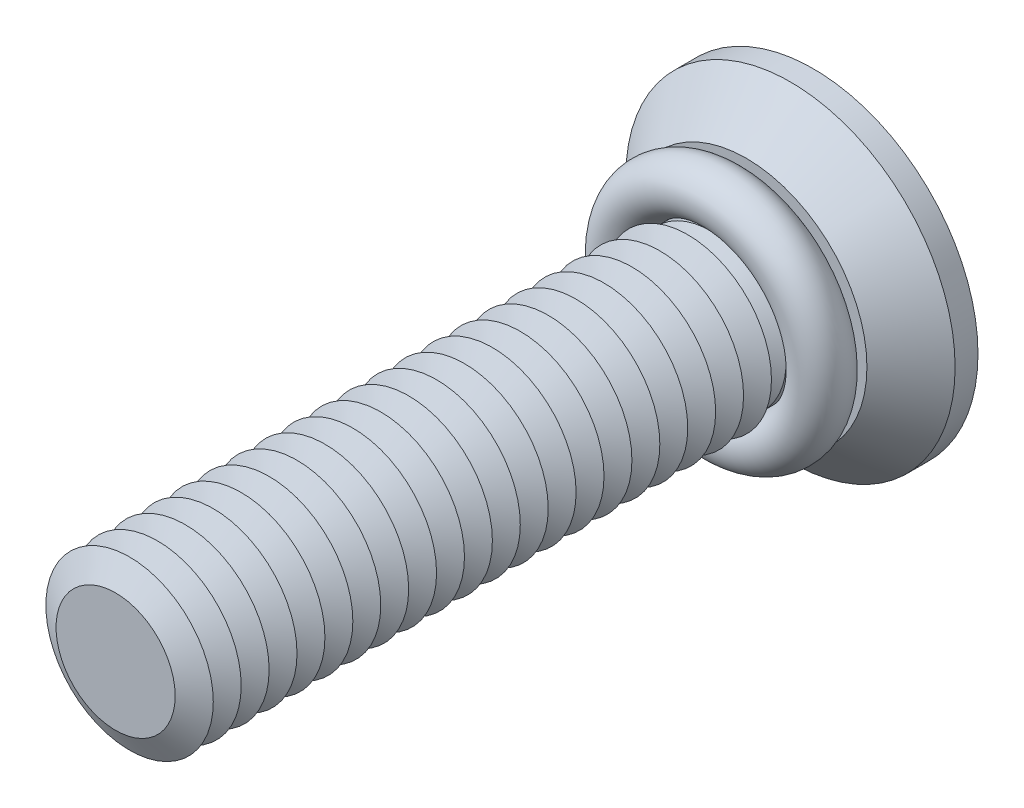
ISO-10303-21;
HEADER;
FILE_DESCRIPTION(('STEP AP214'),'2;1');
FILE_NAME('part.step','',(''),(''),'','','');
FILE_SCHEMA(('AUTOMOTIVE_DESIGN { 1 0 10303 214 1 1 1 1 }'));
ENDSEC;
DATA;
#1=APPLICATION_CONTEXT('core data for automotive mechanical design processes');
#2=APPLICATION_PROTOCOL_DEFINITION('international standard','automotive_design',2000,#1);
#3=PRODUCT_CONTEXT('',#1,'mechanical');
#4=PRODUCT('Part','Part','',(#3));
#5=PRODUCT_RELATED_PRODUCT_CATEGORY('part','',(#4));
#6=PRODUCT_DEFINITION_FORMATION('','',#4);
#7=PRODUCT_DEFINITION_CONTEXT('part definition',#1,'design');
#8=PRODUCT_DEFINITION('design','',#6,#7);
#9=PRODUCT_DEFINITION_SHAPE('','',#8);
#10=(LENGTH_UNIT() NAMED_UNIT(*) SI_UNIT(.MILLI.,.METRE.));
#11=(NAMED_UNIT(*) PLANE_ANGLE_UNIT() SI_UNIT($,.RADIAN.));
#12=(NAMED_UNIT(*) SI_UNIT($,.STERADIAN.) SOLID_ANGLE_UNIT());
#13=UNCERTAINTY_MEASURE_WITH_UNIT(LENGTH_MEASURE(1.E-05),#10,'distance_accuracy_value','');
#14=(GEOMETRIC_REPRESENTATION_CONTEXT(3) GLOBAL_UNCERTAINTY_ASSIGNED_CONTEXT((#13)) GLOBAL_UNIT_ASSIGNED_CONTEXT((#10,
#11,#12)) REPRESENTATION_CONTEXT('',''));
#15=CARTESIAN_POINT('',(0.,0.,0.));
#16=DIRECTION('',(0.,0.,1.));
#17=DIRECTION('',(1.,0.,0.));
#18=AXIS2_PLACEMENT_3D('',#15,#16,#17);
#19=CARTESIAN_POINT('',(0.,0.,3.30000000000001));
#20=DIRECTION('',(0.,0.,1.));
#21=DIRECTION('',(1.,0.,0.));
#22=AXIS2_PLACEMENT_3D('',#19,#20,#21);
#23=TOROIDAL_SURFACE('',#22,3.6,0.9);
#24=CARTESIAN_POINT('',(0.,3.6,3.30000000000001));
#25=DIRECTION('',(1.,0.,0.));
#26=DIRECTION('',(0.,0.,-1.));
#27=AXIS2_PLACEMENT_3D('',#24,#25,#26);
#28=CIRCLE('',#27,0.9);
#29=CARTESIAN_POINT('',(0.,4.5,3.30000000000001));
#30=VERTEX_POINT('',#29);
#31=EDGE_CURVE('P0_E10',#30,#30,#28,.T.);
#32=CARTESIAN_POINT('',(0.,0.,3.30000000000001));
#33=DIRECTION('',(0.,0.,1.));
#34=DIRECTION('',(1.,0.,0.));
#35=AXIS2_PLACEMENT_3D('',#32,#33,#34);
#36=CIRCLE('',#35,4.5);
#37=EDGE_CURVE('',#30,#30,#36,.T.);
#38=ORIENTED_EDGE('',*,*,#31,.F.);
#39=ORIENTED_EDGE('',*,*,#31,.T.);
#40=ORIENTED_EDGE('',*,*,#37,.T.);
#41=ORIENTED_EDGE('',*,*,#37,.F.);
#42=EDGE_LOOP('',(#38,#40,#39,#41));
#43=FACE_BOUND('',#42,.T.);
#44=ADVANCED_FACE('P0_F14',(#43),#23,.T.);
#45=CLOSED_SHELL('',(#44));
#46=MANIFOLD_SOLID_BREP('P0_B1',#45);
#47=CARTESIAN_POINT('',(0.,0.,20.));
#48=DIRECTION('',(0.,0.,-1.));
#49=DIRECTION('',(-1.,0.,0.));
#50=AXIS2_PLACEMENT_3D('',#47,#48,#49);
#51=CONICAL_SURFACE('',#50,2.13397459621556,1.0471975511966);
#52=CARTESIAN_POINT('',(0.,0.,19.5));
#53=DIRECTION('',(0.,0.,1.));
#54=DIRECTION('',(1.,0.,0.));
#55=AXIS2_PLACEMENT_3D('',#52,#53,#54);
#56=CIRCLE('',#55,3.);
#57=CARTESIAN_POINT('',(3.,0.,19.5));
#58=VERTEX_POINT('',#57);
#59=EDGE_CURVE('P1_E324',#58,#58,#56,.T.);
#60=ORIENTED_EDGE('',*,*,#59,.T.);
#61=EDGE_LOOP('',(#60));
#62=FACE_BOUND('',#61,.T.);
#63=CARTESIAN_POINT('',(0.,0.,20.));
#64=DIRECTION('',(0.,0.,1.));
#65=DIRECTION('',(1.,0.,0.));
#66=AXIS2_PLACEMENT_3D('',#63,#64,#65);
#67=CIRCLE('',#66,2.13397459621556);
#68=CARTESIAN_POINT('',(2.13397459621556,0.,20.));
#69=VERTEX_POINT('',#68);
#70=EDGE_CURVE('P1_E321',#69,#69,#67,.T.);
#71=ORIENTED_EDGE('',*,*,#70,.F.);
#72=EDGE_LOOP('',(#71));
#73=FACE_BOUND('',#72,.T.);
#74=ADVANCED_FACE('P1_F15',(#62,#73),#51,.T.);
#75=CARTESIAN_POINT('',(0.,0.,20.5));
#76=DIRECTION('',(0.,0.,1.));
#77=DIRECTION('',(1.,0.,0.));
#78=AXIS2_PLACEMENT_3D('',#75,#76,#77);
#79=CONICAL_SURFACE('',#78,3.,1.0471975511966);
#80=ORIENTED_EDGE('',*,*,#70,.T.);
#81=EDGE_LOOP('',(#80));
#82=FACE_BOUND('',#81,.T.);
#83=CARTESIAN_POINT('',(0.,0.,20.5));
#84=DIRECTION('',(0.,0.,1.));
#85=DIRECTION('',(1.,0.,0.));
#86=AXIS2_PLACEMENT_3D('',#83,#84,#85);
#87=CIRCLE('',#86,3.);
#88=CARTESIAN_POINT('',(3.,0.,20.5));
#89=VERTEX_POINT('',#88);
#90=EDGE_CURVE('P1_E318',#89,#89,#87,.T.);
#91=ORIENTED_EDGE('',*,*,#90,.F.);
#92=EDGE_LOOP('',(#91));
#93=FACE_BOUND('',#92,.T.);
#94=ADVANCED_FACE('P1_F245',(#82,#93),#79,.T.);
#95=CARTESIAN_POINT('',(0.,0.,25.));
#96=DIRECTION('',(0.,0.,1.));
#97=DIRECTION('',(1.,0.,0.));
#98=AXIS2_PLACEMENT_3D('',#95,#96,#97);
#99=PLANE('',#98);
#100=CARTESIAN_POINT('',(0.,0.,25.));
#101=DIRECTION('',(0.,0.,1.));
#102=DIRECTION('',(1.,0.,0.));
#103=AXIS2_PLACEMENT_3D('',#100,#101,#102);
#104=CIRCLE('',#103,2.13397459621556);
#105=CARTESIAN_POINT('',(2.13397459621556,0.,25.));
#106=VERTEX_POINT('',#105);
#107=EDGE_CURVE('P1_E131',#106,#106,#104,.T.);
#108=ORIENTED_EDGE('',*,*,#107,.T.);
#109=EDGE_LOOP('',(#108));
#110=FACE_BOUND('',#109,.T.);
#111=ADVANCED_FACE('P1_F251',(#110),#99,.T.);
#112=CARTESIAN_POINT('',(0.,0.,25.));
#113=DIRECTION('',(0.,0.,-1.));
#114=DIRECTION('',(-1.,0.,0.));
#115=AXIS2_PLACEMENT_3D('',#112,#113,#114);
#116=CONICAL_SURFACE('',#115,2.13397459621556,1.0471975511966);
#117=CARTESIAN_POINT('',(0.,0.,24.5));
#118=DIRECTION('',(0.,0.,1.));
#119=DIRECTION('',(1.,0.,0.));
#120=AXIS2_PLACEMENT_3D('',#117,#118,#119);
#121=CIRCLE('',#120,3.);
#122=CARTESIAN_POINT('',(3.,0.,24.5));
#123=VERTEX_POINT('',#122);
#124=EDGE_CURVE('P1_E133',#123,#123,#121,.T.);
#125=ORIENTED_EDGE('',*,*,#124,.T.);
#126=EDGE_LOOP('',(#125));
#127=FACE_BOUND('',#126,.T.);
#128=ORIENTED_EDGE('',*,*,#107,.F.);
#129=EDGE_LOOP('',(#128));
#130=FACE_BOUND('',#129,.T.);
#131=ADVANCED_FACE('P1_F196',(#127,#130),#116,.T.);
#132=CARTESIAN_POINT('',(0.,0.,24.5));
#133=DIRECTION('',(0.,0.,1.));
#134=DIRECTION('',(1.,0.,0.));
#135=AXIS2_PLACEMENT_3D('',#132,#133,#134);
#136=CONICAL_SURFACE('',#135,3.,1.0471975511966);
#137=CARTESIAN_POINT('',(0.,0.,24.));
#138=DIRECTION('',(0.,0.,1.));
#139=DIRECTION('',(1.,0.,0.));
#140=AXIS2_PLACEMENT_3D('',#137,#138,#139);
#141=CIRCLE('',#140,2.13397459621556);
#142=CARTESIAN_POINT('',(2.13397459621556,0.,24.));
#143=VERTEX_POINT('',#142);
#144=EDGE_CURVE('P1_E297',#143,#143,#141,.T.);
#145=ORIENTED_EDGE('',*,*,#144,.T.);
#146=EDGE_LOOP('',(#145));
#147=FACE_BOUND('',#146,.T.);
#148=ORIENTED_EDGE('',*,*,#124,.F.);
#149=EDGE_LOOP('',(#148));
#150=FACE_BOUND('',#149,.T.);
#151=ADVANCED_FACE('P1_F284',(#147,#150),#136,.T.);
#152=CARTESIAN_POINT('',(0.,0.,24.));
#153=DIRECTION('',(0.,0.,-1.));
#154=DIRECTION('',(-1.,0.,0.));
#155=AXIS2_PLACEMENT_3D('',#152,#153,#154);
#156=CONICAL_SURFACE('',#155,2.13397459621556,1.0471975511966);
#157=CARTESIAN_POINT('',(0.,0.,23.5));
#158=DIRECTION('',(0.,0.,1.));
#159=DIRECTION('',(1.,0.,0.));
#160=AXIS2_PLACEMENT_3D('',#157,#158,#159);
#161=CIRCLE('',#160,3.);
#162=CARTESIAN_POINT('',(3.,0.,23.5));
#163=VERTEX_POINT('',#162);
#164=EDGE_CURVE('P1_E294',#163,#163,#161,.T.);
#165=ORIENTED_EDGE('',*,*,#164,.T.);
#166=EDGE_LOOP('',(#165));
#167=FACE_BOUND('',#166,.T.);
#168=ORIENTED_EDGE('',*,*,#144,.F.);
#169=EDGE_LOOP('',(#168));
#170=FACE_BOUND('',#169,.T.);
#171=ADVANCED_FACE('P1_F279',(#167,#170),#156,.T.);
#172=CARTESIAN_POINT('',(0.,0.,23.5));
#173=DIRECTION('',(0.,0.,1.));
#174=DIRECTION('',(1.,0.,0.));
#175=AXIS2_PLACEMENT_3D('',#172,#173,#174);
#176=CONICAL_SURFACE('',#175,3.,1.0471975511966);
#177=CARTESIAN_POINT('',(0.,0.,23.));
#178=DIRECTION('',(0.,0.,1.));
#179=DIRECTION('',(1.,0.,0.));
#180=AXIS2_PLACEMENT_3D('',#177,#178,#179);
#181=CIRCLE('',#180,2.13397459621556);
#182=CARTESIAN_POINT('',(2.13397459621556,0.,23.));
#183=VERTEX_POINT('',#182);
#184=EDGE_CURVE('P1_E301',#183,#183,#181,.T.);
#185=ORIENTED_EDGE('',*,*,#184,.T.);
#186=EDGE_LOOP('',(#185));
#187=FACE_BOUND('',#186,.T.);
#188=ORIENTED_EDGE('',*,*,#164,.F.);
#189=EDGE_LOOP('',(#188));
#190=FACE_BOUND('',#189,.T.);
#191=ADVANCED_FACE('P1_F276',(#187,#190),#176,.T.);
#192=CARTESIAN_POINT('',(0.,0.,23.));
#193=DIRECTION('',(0.,0.,-1.));
#194=DIRECTION('',(-1.,0.,0.));
#195=AXIS2_PLACEMENT_3D('',#192,#193,#194);
#196=CONICAL_SURFACE('',#195,2.13397459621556,1.0471975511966);
#197=CARTESIAN_POINT('',(0.,0.,22.5));
#198=DIRECTION('',(0.,0.,1.));
#199=DIRECTION('',(1.,0.,0.));
#200=AXIS2_PLACEMENT_3D('',#197,#198,#199);
#201=CIRCLE('',#200,3.);
#202=CARTESIAN_POINT('',(3.,0.,22.5));
#203=VERTEX_POINT('',#202);
#204=EDGE_CURVE('P1_E306',#203,#203,#201,.T.);
#205=ORIENTED_EDGE('',*,*,#204,.T.);
#206=EDGE_LOOP('',(#205));
#207=FACE_BOUND('',#206,.T.);
#208=ORIENTED_EDGE('',*,*,#184,.F.);
#209=EDGE_LOOP('',(#208));
#210=FACE_BOUND('',#209,.T.);
#211=ADVANCED_FACE('P1_F271',(#207,#210),#196,.T.);
#212=CARTESIAN_POINT('',(0.,0.,22.5));
#213=DIRECTION('',(0.,0.,1.));
#214=DIRECTION('',(1.,0.,0.));
#215=AXIS2_PLACEMENT_3D('',#212,#213,#214);
#216=CONICAL_SURFACE('',#215,3.,1.0471975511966);
#217=CARTESIAN_POINT('',(0.,0.,22.));
#218=DIRECTION('',(0.,0.,1.));
#219=DIRECTION('',(1.,0.,0.));
#220=AXIS2_PLACEMENT_3D('',#217,#218,#219);
#221=CIRCLE('',#220,2.13397459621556);
#222=CARTESIAN_POINT('',(2.13397459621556,0.,22.));
#223=VERTEX_POINT('',#222);
#224=EDGE_CURVE('P1_E309',#223,#223,#221,.T.);
#225=ORIENTED_EDGE('',*,*,#224,.T.);
#226=EDGE_LOOP('',(#225));
#227=FACE_BOUND('',#226,.T.);
#228=ORIENTED_EDGE('',*,*,#204,.F.);
#229=EDGE_LOOP('',(#228));
#230=FACE_BOUND('',#229,.T.);
#231=ADVANCED_FACE('P1_F268',(#227,#230),#216,.T.);
#232=CARTESIAN_POINT('',(0.,0.,22.));
#233=DIRECTION('',(0.,0.,-1.));
#234=DIRECTION('',(-1.,0.,0.));
#235=AXIS2_PLACEMENT_3D('',#232,#233,#234);
#236=CONICAL_SURFACE('',#235,2.13397459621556,1.0471975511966);
#237=CARTESIAN_POINT('',(0.,0.,21.5));
#238=DIRECTION('',(0.,0.,1.));
#239=DIRECTION('',(1.,0.,0.));
#240=AXIS2_PLACEMENT_3D('',#237,#238,#239);
#241=CIRCLE('',#240,3.);
#242=CARTESIAN_POINT('',(3.,0.,21.5));
#243=VERTEX_POINT('',#242);
#244=EDGE_CURVE('P1_E312',#243,#243,#241,.T.);
#245=ORIENTED_EDGE('',*,*,#244,.T.);
#246=EDGE_LOOP('',(#245));
#247=FACE_BOUND('',#246,.T.);
#248=ORIENTED_EDGE('',*,*,#224,.F.);
#249=EDGE_LOOP('',(#248));
#250=FACE_BOUND('',#249,.T.);
#251=ADVANCED_FACE('P1_F262',(#247,#250),#236,.T.);
#252=CARTESIAN_POINT('',(0.,0.,21.5));
#253=DIRECTION('',(0.,0.,1.));
#254=DIRECTION('',(1.,0.,0.));
#255=AXIS2_PLACEMENT_3D('',#252,#253,#254);
#256=CONICAL_SURFACE('',#255,3.,1.0471975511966);
#257=CARTESIAN_POINT('',(0.,0.,21.));
#258=DIRECTION('',(0.,0.,1.));
#259=DIRECTION('',(1.,0.,0.));
#260=AXIS2_PLACEMENT_3D('',#257,#258,#259);
#261=CIRCLE('',#260,2.13397459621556);
#262=CARTESIAN_POINT('',(2.13397459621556,0.,21.));
#263=VERTEX_POINT('',#262);
#264=EDGE_CURVE('P1_E315',#263,#263,#261,.T.);
#265=ORIENTED_EDGE('',*,*,#264,.T.);
#266=EDGE_LOOP('',(#265));
#267=FACE_BOUND('',#266,.T.);
#268=ORIENTED_EDGE('',*,*,#244,.F.);
#269=EDGE_LOOP('',(#268));
#270=FACE_BOUND('',#269,.T.);
#271=ADVANCED_FACE('P1_F258',(#267,#270),#256,.T.);
#272=CARTESIAN_POINT('',(0.,0.,21.));
#273=DIRECTION('',(0.,0.,-1.));
#274=DIRECTION('',(-1.,0.,0.));
#275=AXIS2_PLACEMENT_3D('',#272,#273,#274);
#276=CONICAL_SURFACE('',#275,2.13397459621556,1.0471975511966);
#277=ORIENTED_EDGE('',*,*,#90,.T.);
#278=EDGE_LOOP('',(#277));
#279=FACE_BOUND('',#278,.T.);
#280=ORIENTED_EDGE('',*,*,#264,.F.);
#281=EDGE_LOOP('',(#280));
#282=FACE_BOUND('',#281,.T.);
#283=ADVANCED_FACE('P1_F261',(#279,#282),#276,.T.);
#284=CARTESIAN_POINT('',(0.,0.,19.));
#285=DIRECTION('',(0.,0.,-1.));
#286=DIRECTION('',(-1.,0.,0.));
#287=AXIS2_PLACEMENT_3D('',#284,#285,#286);
#288=CONICAL_SURFACE('',#287,2.13397459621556,1.0471975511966);
#289=CARTESIAN_POINT('',(0.,0.,18.5));
#290=DIRECTION('',(0.,0.,1.));
#291=DIRECTION('',(1.,0.,0.));
#292=AXIS2_PLACEMENT_3D('',#289,#290,#291);
#293=CIRCLE('',#292,3.);
#294=CARTESIAN_POINT('',(3.,0.,18.5));
#295=VERTEX_POINT('',#294);
#296=EDGE_CURVE('P1_E329',#295,#295,#293,.T.);
#297=ORIENTED_EDGE('',*,*,#296,.T.);
#298=EDGE_LOOP('',(#297));
#299=FACE_BOUND('',#298,.T.);
#300=CARTESIAN_POINT('',(0.,0.,19.));
#301=DIRECTION('',(0.,0.,1.));
#302=DIRECTION('',(1.,0.,0.));
#303=AXIS2_PLACEMENT_3D('',#300,#301,#302);
#304=CIRCLE('',#303,2.13397459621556);
#305=CARTESIAN_POINT('',(2.13397459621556,0.,19.));
#306=VERTEX_POINT('',#305);
#307=EDGE_CURVE('P1_E326',#306,#306,#304,.T.);
#308=ORIENTED_EDGE('',*,*,#307,.F.);
#309=EDGE_LOOP('',(#308));
#310=FACE_BOUND('',#309,.T.);
#311=ADVANCED_FACE('P1_F266',(#299,#310),#288,.T.);
#312=CARTESIAN_POINT('',(0.,0.,19.5));
#313=DIRECTION('',(0.,0.,1.));
#314=DIRECTION('',(1.,0.,0.));
#315=AXIS2_PLACEMENT_3D('',#312,#313,#314);
#316=CONICAL_SURFACE('',#315,3.,1.0471975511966);
#317=ORIENTED_EDGE('',*,*,#307,.T.);
#318=EDGE_LOOP('',(#317));
#319=FACE_BOUND('',#318,.T.);
#320=ORIENTED_EDGE('',*,*,#59,.F.);
#321=EDGE_LOOP('',(#320));
#322=FACE_BOUND('',#321,.T.);
#323=ADVANCED_FACE('P1_F522',(#319,#322),#316,.T.);
#324=CARTESIAN_POINT('',(0.,0.,18.));
#325=DIRECTION('',(0.,0.,-1.));
#326=DIRECTION('',(-1.,0.,0.));
#327=AXIS2_PLACEMENT_3D('',#324,#325,#326);
#328=CONICAL_SURFACE('',#327,2.13397459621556,1.0471975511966);
#329=CARTESIAN_POINT('',(0.,0.,17.5));
#330=DIRECTION('',(0.,0.,1.));
#331=DIRECTION('',(1.,0.,0.));
#332=AXIS2_PLACEMENT_3D('',#329,#330,#331);
#333=CIRCLE('',#332,3.);
#334=CARTESIAN_POINT('',(3.,0.,17.5));
#335=VERTEX_POINT('',#334);
#336=EDGE_CURVE('P1_E335',#335,#335,#333,.T.);
#337=ORIENTED_EDGE('',*,*,#336,.T.);
#338=EDGE_LOOP('',(#337));
#339=FACE_BOUND('',#338,.T.);
#340=CARTESIAN_POINT('',(0.,0.,18.));
#341=DIRECTION('',(0.,0.,1.));
#342=DIRECTION('',(1.,0.,0.));
#343=AXIS2_PLACEMENT_3D('',#340,#341,#342);
#344=CIRCLE('',#343,2.13397459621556);
#345=CARTESIAN_POINT('',(2.13397459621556,0.,18.));
#346=VERTEX_POINT('',#345);
#347=EDGE_CURVE('P1_E332',#346,#346,#344,.T.);
#348=ORIENTED_EDGE('',*,*,#347,.F.);
#349=EDGE_LOOP('',(#348));
#350=FACE_BOUND('',#349,.T.);
#351=ADVANCED_FACE('P1_F531',(#339,#350),#328,.T.);
#352=CARTESIAN_POINT('',(0.,0.,18.5));
#353=DIRECTION('',(0.,0.,1.));
#354=DIRECTION('',(1.,0.,0.));
#355=AXIS2_PLACEMENT_3D('',#352,#353,#354);
#356=CONICAL_SURFACE('',#355,3.,1.0471975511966);
#357=ORIENTED_EDGE('',*,*,#347,.T.);
#358=EDGE_LOOP('',(#357));
#359=FACE_BOUND('',#358,.T.);
#360=ORIENTED_EDGE('',*,*,#296,.F.);
#361=EDGE_LOOP('',(#360));
#362=FACE_BOUND('',#361,.T.);
#363=ADVANCED_FACE('P1_F541',(#359,#362),#356,.T.);
#364=CARTESIAN_POINT('',(0.,0.,17.));
#365=DIRECTION('',(0.,0.,-1.));
#366=DIRECTION('',(-1.,0.,0.));
#367=AXIS2_PLACEMENT_3D('',#364,#365,#366);
#368=CONICAL_SURFACE('',#367,2.13397459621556,1.0471975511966);
#369=CARTESIAN_POINT('',(0.,0.,16.5));
#370=DIRECTION('',(0.,0.,1.));
#371=DIRECTION('',(1.,0.,0.));
#372=AXIS2_PLACEMENT_3D('',#369,#370,#371);
#373=CIRCLE('',#372,3.);
#374=CARTESIAN_POINT('',(3.,0.,16.5));
#375=VERTEX_POINT('',#374);
#376=EDGE_CURVE('P1_E341',#375,#375,#373,.T.);
#377=ORIENTED_EDGE('',*,*,#376,.T.);
#378=EDGE_LOOP('',(#377));
#379=FACE_BOUND('',#378,.T.);
#380=CARTESIAN_POINT('',(0.,0.,17.));
#381=DIRECTION('',(0.,0.,1.));
#382=DIRECTION('',(1.,0.,0.));
#383=AXIS2_PLACEMENT_3D('',#380,#381,#382);
#384=CIRCLE('',#383,2.13397459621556);
#385=CARTESIAN_POINT('',(2.13397459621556,0.,17.));
#386=VERTEX_POINT('',#385);
#387=EDGE_CURVE('P1_E338',#386,#386,#384,.T.);
#388=ORIENTED_EDGE('',*,*,#387,.F.);
#389=EDGE_LOOP('',(#388));
#390=FACE_BOUND('',#389,.T.);
#391=ADVANCED_FACE('P1_F551',(#379,#390),#368,.T.);
#392=CARTESIAN_POINT('',(0.,0.,17.5));
#393=DIRECTION('',(0.,0.,1.));
#394=DIRECTION('',(1.,0.,0.));
#395=AXIS2_PLACEMENT_3D('',#392,#393,#394);
#396=CONICAL_SURFACE('',#395,3.,1.0471975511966);
#397=ORIENTED_EDGE('',*,*,#387,.T.);
#398=EDGE_LOOP('',(#397));
#399=FACE_BOUND('',#398,.T.);
#400=ORIENTED_EDGE('',*,*,#336,.F.);
#401=EDGE_LOOP('',(#400));
#402=FACE_BOUND('',#401,.T.);
#403=ADVANCED_FACE('P1_F561',(#399,#402),#396,.T.);
#404=CARTESIAN_POINT('',(0.,0.,16.));
#405=DIRECTION('',(0.,0.,-1.));
#406=DIRECTION('',(-1.,0.,0.));
#407=AXIS2_PLACEMENT_3D('',#404,#405,#406);
#408=CONICAL_SURFACE('',#407,2.13397459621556,1.0471975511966);
#409=CARTESIAN_POINT('',(0.,0.,15.5));
#410=DIRECTION('',(0.,0.,1.));
#411=DIRECTION('',(1.,0.,0.));
#412=AXIS2_PLACEMENT_3D('',#409,#410,#411);
#413=CIRCLE('',#412,3.);
#414=CARTESIAN_POINT('',(3.,0.,15.5));
#415=VERTEX_POINT('',#414);
#416=EDGE_CURVE('P1_E347',#415,#415,#413,.T.);
#417=ORIENTED_EDGE('',*,*,#416,.T.);
#418=EDGE_LOOP('',(#417));
#419=FACE_BOUND('',#418,.T.);
#420=CARTESIAN_POINT('',(0.,0.,16.));
#421=DIRECTION('',(0.,0.,1.));
#422=DIRECTION('',(1.,0.,0.));
#423=AXIS2_PLACEMENT_3D('',#420,#421,#422);
#424=CIRCLE('',#423,2.13397459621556);
#425=CARTESIAN_POINT('',(2.13397459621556,0.,16.));
#426=VERTEX_POINT('',#425);
#427=EDGE_CURVE('P1_E344',#426,#426,#424,.T.);
#428=ORIENTED_EDGE('',*,*,#427,.F.);
#429=EDGE_LOOP('',(#428));
#430=FACE_BOUND('',#429,.T.);
#431=ADVANCED_FACE('P1_F571',(#419,#430),#408,.T.);
#432=CARTESIAN_POINT('',(0.,0.,16.5));
#433=DIRECTION('',(0.,0.,1.));
#434=DIRECTION('',(1.,0.,0.));
#435=AXIS2_PLACEMENT_3D('',#432,#433,#434);
#436=CONICAL_SURFACE('',#435,3.,1.0471975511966);
#437=ORIENTED_EDGE('',*,*,#427,.T.);
#438=EDGE_LOOP('',(#437));
#439=FACE_BOUND('',#438,.T.);
#440=ORIENTED_EDGE('',*,*,#376,.F.);
#441=EDGE_LOOP('',(#440));
#442=FACE_BOUND('',#441,.T.);
#443=ADVANCED_FACE('P1_F581',(#439,#442),#436,.T.);
#444=CARTESIAN_POINT('',(0.,0.,15.));
#445=DIRECTION('',(0.,0.,-1.));
#446=DIRECTION('',(-1.,0.,0.));
#447=AXIS2_PLACEMENT_3D('',#444,#445,#446);
#448=CONICAL_SURFACE('',#447,2.13397459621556,1.0471975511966);
#449=CARTESIAN_POINT('',(0.,0.,14.5));
#450=DIRECTION('',(0.,0.,1.));
#451=DIRECTION('',(1.,0.,0.));
#452=AXIS2_PLACEMENT_3D('',#449,#450,#451);
#453=CIRCLE('',#452,3.);
#454=CARTESIAN_POINT('',(3.,0.,14.5));
#455=VERTEX_POINT('',#454);
#456=EDGE_CURVE('P1_E353',#455,#455,#453,.T.);
#457=ORIENTED_EDGE('',*,*,#456,.T.);
#458=EDGE_LOOP('',(#457));
#459=FACE_BOUND('',#458,.T.);
#460=CARTESIAN_POINT('',(0.,0.,15.));
#461=DIRECTION('',(0.,0.,1.));
#462=DIRECTION('',(1.,0.,0.));
#463=AXIS2_PLACEMENT_3D('',#460,#461,#462);
#464=CIRCLE('',#463,2.13397459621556);
#465=CARTESIAN_POINT('',(2.13397459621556,0.,15.));
#466=VERTEX_POINT('',#465);
#467=EDGE_CURVE('P1_E350',#466,#466,#464,.T.);
#468=ORIENTED_EDGE('',*,*,#467,.F.);
#469=EDGE_LOOP('',(#468));
#470=FACE_BOUND('',#469,.T.);
#471=ADVANCED_FACE('P1_F591',(#459,#470),#448,.T.);
#472=CARTESIAN_POINT('',(0.,0.,15.5));
#473=DIRECTION('',(0.,0.,1.));
#474=DIRECTION('',(1.,0.,0.));
#475=AXIS2_PLACEMENT_3D('',#472,#473,#474);
#476=CONICAL_SURFACE('',#475,3.,1.0471975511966);
#477=ORIENTED_EDGE('',*,*,#467,.T.);
#478=EDGE_LOOP('',(#477));
#479=FACE_BOUND('',#478,.T.);
#480=ORIENTED_EDGE('',*,*,#416,.F.);
#481=EDGE_LOOP('',(#480));
#482=FACE_BOUND('',#481,.T.);
#483=ADVANCED_FACE('P1_F601',(#479,#482),#476,.T.);
#484=CARTESIAN_POINT('',(0.,0.,14.));
#485=DIRECTION('',(0.,0.,-1.));
#486=DIRECTION('',(-1.,0.,0.));
#487=AXIS2_PLACEMENT_3D('',#484,#485,#486);
#488=CONICAL_SURFACE('',#487,2.13397459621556,1.0471975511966);
#489=CARTESIAN_POINT('',(0.,0.,13.5));
#490=DIRECTION('',(0.,0.,1.));
#491=DIRECTION('',(1.,0.,0.));
#492=AXIS2_PLACEMENT_3D('',#489,#490,#491);
#493=CIRCLE('',#492,3.);
#494=CARTESIAN_POINT('',(3.,0.,13.5));
#495=VERTEX_POINT('',#494);
#496=EDGE_CURVE('P1_E359',#495,#495,#493,.T.);
#497=ORIENTED_EDGE('',*,*,#496,.T.);
#498=EDGE_LOOP('',(#497));
#499=FACE_BOUND('',#498,.T.);
#500=CARTESIAN_POINT('',(0.,0.,14.));
#501=DIRECTION('',(0.,0.,1.));
#502=DIRECTION('',(1.,0.,0.));
#503=AXIS2_PLACEMENT_3D('',#500,#501,#502);
#504=CIRCLE('',#503,2.13397459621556);
#505=CARTESIAN_POINT('',(2.13397459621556,0.,14.));
#506=VERTEX_POINT('',#505);
#507=EDGE_CURVE('P1_E356',#506,#506,#504,.T.);
#508=ORIENTED_EDGE('',*,*,#507,.F.);
#509=EDGE_LOOP('',(#508));
#510=FACE_BOUND('',#509,.T.);
#511=ADVANCED_FACE('P1_F611',(#499,#510),#488,.T.);
#512=CARTESIAN_POINT('',(0.,0.,14.5));
#513=DIRECTION('',(0.,0.,1.));
#514=DIRECTION('',(1.,0.,0.));
#515=AXIS2_PLACEMENT_3D('',#512,#513,#514);
#516=CONICAL_SURFACE('',#515,3.,1.0471975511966);
#517=ORIENTED_EDGE('',*,*,#507,.T.);
#518=EDGE_LOOP('',(#517));
#519=FACE_BOUND('',#518,.T.);
#520=ORIENTED_EDGE('',*,*,#456,.F.);
#521=EDGE_LOOP('',(#520));
#522=FACE_BOUND('',#521,.T.);
#523=ADVANCED_FACE('P1_F621',(#519,#522),#516,.T.);
#524=CARTESIAN_POINT('',(0.,0.,13.));
#525=DIRECTION('',(0.,0.,-1.));
#526=DIRECTION('',(-1.,0.,0.));
#527=AXIS2_PLACEMENT_3D('',#524,#525,#526);
#528=CONICAL_SURFACE('',#527,2.13397459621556,1.0471975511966);
#529=CARTESIAN_POINT('',(0.,0.,12.5));
#530=DIRECTION('',(0.,0.,1.));
#531=DIRECTION('',(1.,0.,0.));
#532=AXIS2_PLACEMENT_3D('',#529,#530,#531);
#533=CIRCLE('',#532,3.);
#534=CARTESIAN_POINT('',(3.,0.,12.5));
#535=VERTEX_POINT('',#534);
#536=EDGE_CURVE('P1_E365',#535,#535,#533,.T.);
#537=ORIENTED_EDGE('',*,*,#536,.T.);
#538=EDGE_LOOP('',(#537));
#539=FACE_BOUND('',#538,.T.);
#540=CARTESIAN_POINT('',(0.,0.,13.));
#541=DIRECTION('',(0.,0.,1.));
#542=DIRECTION('',(1.,0.,0.));
#543=AXIS2_PLACEMENT_3D('',#540,#541,#542);
#544=CIRCLE('',#543,2.13397459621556);
#545=CARTESIAN_POINT('',(2.13397459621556,0.,13.));
#546=VERTEX_POINT('',#545);
#547=EDGE_CURVE('P1_E362',#546,#546,#544,.T.);
#548=ORIENTED_EDGE('',*,*,#547,.F.);
#549=EDGE_LOOP('',(#548));
#550=FACE_BOUND('',#549,.T.);
#551=ADVANCED_FACE('P1_F631',(#539,#550),#528,.T.);
#552=CARTESIAN_POINT('',(0.,0.,13.5));
#553=DIRECTION('',(0.,0.,1.));
#554=DIRECTION('',(1.,0.,0.));
#555=AXIS2_PLACEMENT_3D('',#552,#553,#554);
#556=CONICAL_SURFACE('',#555,3.,1.0471975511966);
#557=ORIENTED_EDGE('',*,*,#547,.T.);
#558=EDGE_LOOP('',(#557));
#559=FACE_BOUND('',#558,.T.);
#560=ORIENTED_EDGE('',*,*,#496,.F.);
#561=EDGE_LOOP('',(#560));
#562=FACE_BOUND('',#561,.T.);
#563=ADVANCED_FACE('P1_F641',(#559,#562),#556,.T.);
#564=CARTESIAN_POINT('',(0.,0.,12.));
#565=DIRECTION('',(0.,0.,-1.));
#566=DIRECTION('',(-1.,0.,0.));
#567=AXIS2_PLACEMENT_3D('',#564,#565,#566);
#568=CONICAL_SURFACE('',#567,2.13397459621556,1.0471975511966);
#569=CARTESIAN_POINT('',(0.,0.,11.5));
#570=DIRECTION('',(0.,0.,1.));
#571=DIRECTION('',(1.,0.,0.));
#572=AXIS2_PLACEMENT_3D('',#569,#570,#571);
#573=CIRCLE('',#572,3.);
#574=CARTESIAN_POINT('',(3.,0.,11.5));
#575=VERTEX_POINT('',#574);
#576=EDGE_CURVE('P1_E371',#575,#575,#573,.T.);
#577=ORIENTED_EDGE('',*,*,#576,.T.);
#578=EDGE_LOOP('',(#577));
#579=FACE_BOUND('',#578,.T.);
#580=CARTESIAN_POINT('',(0.,0.,12.));
#581=DIRECTION('',(0.,0.,1.));
#582=DIRECTION('',(1.,0.,0.));
#583=AXIS2_PLACEMENT_3D('',#580,#581,#582);
#584=CIRCLE('',#583,2.13397459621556);
#585=CARTESIAN_POINT('',(2.13397459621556,0.,12.));
#586=VERTEX_POINT('',#585);
#587=EDGE_CURVE('P1_E368',#586,#586,#584,.T.);
#588=ORIENTED_EDGE('',*,*,#587,.F.);
#589=EDGE_LOOP('',(#588));
#590=FACE_BOUND('',#589,.T.);
#591=ADVANCED_FACE('P1_F651',(#579,#590),#568,.T.);
#592=CARTESIAN_POINT('',(0.,0.,12.5));
#593=DIRECTION('',(0.,0.,1.));
#594=DIRECTION('',(1.,0.,0.));
#595=AXIS2_PLACEMENT_3D('',#592,#593,#594);
#596=CONICAL_SURFACE('',#595,3.,1.0471975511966);
#597=ORIENTED_EDGE('',*,*,#587,.T.);
#598=EDGE_LOOP('',(#597));
#599=FACE_BOUND('',#598,.T.);
#600=ORIENTED_EDGE('',*,*,#536,.F.);
#601=EDGE_LOOP('',(#600));
#602=FACE_BOUND('',#601,.T.);
#603=ADVANCED_FACE('P1_F661',(#599,#602),#596,.T.);
#604=CARTESIAN_POINT('',(0.,0.,11.));
#605=DIRECTION('',(0.,0.,-1.));
#606=DIRECTION('',(-1.,0.,0.));
#607=AXIS2_PLACEMENT_3D('',#604,#605,#606);
#608=CONICAL_SURFACE('',#607,2.13397459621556,1.0471975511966);
#609=CARTESIAN_POINT('',(0.,0.,10.5));
#610=DIRECTION('',(0.,0.,1.));
#611=DIRECTION('',(1.,0.,0.));
#612=AXIS2_PLACEMENT_3D('',#609,#610,#611);
#613=CIRCLE('',#612,3.);
#614=CARTESIAN_POINT('',(3.,0.,10.5));
#615=VERTEX_POINT('',#614);
#616=EDGE_CURVE('P1_E377',#615,#615,#613,.T.);
#617=ORIENTED_EDGE('',*,*,#616,.T.);
#618=EDGE_LOOP('',(#617));
#619=FACE_BOUND('',#618,.T.);
#620=CARTESIAN_POINT('',(0.,0.,11.));
#621=DIRECTION('',(0.,0.,1.));
#622=DIRECTION('',(1.,0.,0.));
#623=AXIS2_PLACEMENT_3D('',#620,#621,#622);
#624=CIRCLE('',#623,2.13397459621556);
#625=CARTESIAN_POINT('',(2.13397459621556,0.,11.));
#626=VERTEX_POINT('',#625);
#627=EDGE_CURVE('P1_E374',#626,#626,#624,.T.);
#628=ORIENTED_EDGE('',*,*,#627,.F.);
#629=EDGE_LOOP('',(#628));
#630=FACE_BOUND('',#629,.T.);
#631=ADVANCED_FACE('P1_F671',(#619,#630),#608,.T.);
#632=CARTESIAN_POINT('',(0.,0.,11.5));
#633=DIRECTION('',(0.,0.,1.));
#634=DIRECTION('',(1.,0.,0.));
#635=AXIS2_PLACEMENT_3D('',#632,#633,#634);
#636=CONICAL_SURFACE('',#635,3.,1.0471975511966);
#637=ORIENTED_EDGE('',*,*,#627,.T.);
#638=EDGE_LOOP('',(#637));
#639=FACE_BOUND('',#638,.T.);
#640=ORIENTED_EDGE('',*,*,#576,.F.);
#641=EDGE_LOOP('',(#640));
#642=FACE_BOUND('',#641,.T.);
#643=ADVANCED_FACE('P1_F681',(#639,#642),#636,.T.);
#644=CARTESIAN_POINT('',(0.,0.,10.));
#645=DIRECTION('',(0.,0.,-1.));
#646=DIRECTION('',(-1.,0.,0.));
#647=AXIS2_PLACEMENT_3D('',#644,#645,#646);
#648=CONICAL_SURFACE('',#647,2.13397459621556,1.0471975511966);
#649=CARTESIAN_POINT('',(0.,0.,9.5));
#650=DIRECTION('',(0.,0.,1.));
#651=DIRECTION('',(1.,0.,0.));
#652=AXIS2_PLACEMENT_3D('',#649,#650,#651);
#653=CIRCLE('',#652,3.);
#654=CARTESIAN_POINT('',(3.,0.,9.5));
#655=VERTEX_POINT('',#654);
#656=EDGE_CURVE('P1_E383',#655,#655,#653,.T.);
#657=ORIENTED_EDGE('',*,*,#656,.T.);
#658=EDGE_LOOP('',(#657));
#659=FACE_BOUND('',#658,.T.);
#660=CARTESIAN_POINT('',(0.,0.,10.));
#661=DIRECTION('',(0.,0.,1.));
#662=DIRECTION('',(1.,0.,0.));
#663=AXIS2_PLACEMENT_3D('',#660,#661,#662);
#664=CIRCLE('',#663,2.13397459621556);
#665=CARTESIAN_POINT('',(2.13397459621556,0.,10.));
#666=VERTEX_POINT('',#665);
#667=EDGE_CURVE('P1_E380',#666,#666,#664,.T.);
#668=ORIENTED_EDGE('',*,*,#667,.F.);
#669=EDGE_LOOP('',(#668));
#670=FACE_BOUND('',#669,.T.);
#671=ADVANCED_FACE('P1_F691',(#659,#670),#648,.T.);
#672=CARTESIAN_POINT('',(0.,0.,10.5));
#673=DIRECTION('',(0.,0.,1.));
#674=DIRECTION('',(1.,0.,0.));
#675=AXIS2_PLACEMENT_3D('',#672,#673,#674);
#676=CONICAL_SURFACE('',#675,3.,1.0471975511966);
#677=ORIENTED_EDGE('',*,*,#667,.T.);
#678=EDGE_LOOP('',(#677));
#679=FACE_BOUND('',#678,.T.);
#680=ORIENTED_EDGE('',*,*,#616,.F.);
#681=EDGE_LOOP('',(#680));
#682=FACE_BOUND('',#681,.T.);
#683=ADVANCED_FACE('P1_F701',(#679,#682),#676,.T.);
#684=CARTESIAN_POINT('',(0.,0.,9.));
#685=DIRECTION('',(0.,0.,-1.));
#686=DIRECTION('',(-1.,0.,0.));
#687=AXIS2_PLACEMENT_3D('',#684,#685,#686);
#688=CONICAL_SURFACE('',#687,2.13397459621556,1.0471975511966);
#689=CARTESIAN_POINT('',(0.,0.,8.5));
#690=DIRECTION('',(0.,0.,1.));
#691=DIRECTION('',(1.,0.,0.));
#692=AXIS2_PLACEMENT_3D('',#689,#690,#691);
#693=CIRCLE('',#692,3.);
#694=CARTESIAN_POINT('',(3.,0.,8.5));
#695=VERTEX_POINT('',#694);
#696=EDGE_CURVE('P1_E389',#695,#695,#693,.T.);
#697=ORIENTED_EDGE('',*,*,#696,.T.);
#698=EDGE_LOOP('',(#697));
#699=FACE_BOUND('',#698,.T.);
#700=CARTESIAN_POINT('',(0.,0.,9.));
#701=DIRECTION('',(0.,0.,1.));
#702=DIRECTION('',(1.,0.,0.));
#703=AXIS2_PLACEMENT_3D('',#700,#701,#702);
#704=CIRCLE('',#703,2.13397459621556);
#705=CARTESIAN_POINT('',(2.13397459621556,0.,9.));
#706=VERTEX_POINT('',#705);
#707=EDGE_CURVE('P1_E386',#706,#706,#704,.T.);
#708=ORIENTED_EDGE('',*,*,#707,.F.);
#709=EDGE_LOOP('',(#708));
#710=FACE_BOUND('',#709,.T.);
#711=ADVANCED_FACE('P1_F711',(#699,#710),#688,.T.);
#712=CARTESIAN_POINT('',(0.,0.,9.5));
#713=DIRECTION('',(0.,0.,1.));
#714=DIRECTION('',(1.,0.,0.));
#715=AXIS2_PLACEMENT_3D('',#712,#713,#714);
#716=CONICAL_SURFACE('',#715,3.,1.0471975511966);
#717=ORIENTED_EDGE('',*,*,#707,.T.);
#718=EDGE_LOOP('',(#717));
#719=FACE_BOUND('',#718,.T.);
#720=ORIENTED_EDGE('',*,*,#656,.F.);
#721=EDGE_LOOP('',(#720));
#722=FACE_BOUND('',#721,.T.);
#723=ADVANCED_FACE('P1_F721',(#719,#722),#716,.T.);
#724=CARTESIAN_POINT('',(0.,0.,8.));
#725=DIRECTION('',(0.,0.,-1.));
#726=DIRECTION('',(-1.,0.,0.));
#727=AXIS2_PLACEMENT_3D('',#724,#725,#726);
#728=CONICAL_SURFACE('',#727,2.13397459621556,1.0471975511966);
#729=CARTESIAN_POINT('',(0.,0.,7.5));
#730=DIRECTION('',(0.,0.,1.));
#731=DIRECTION('',(1.,0.,0.));
#732=AXIS2_PLACEMENT_3D('',#729,#730,#731);
#733=CIRCLE('',#732,3.);
#734=CARTESIAN_POINT('',(3.,0.,7.5));
#735=VERTEX_POINT('',#734);
#736=EDGE_CURVE('P1_E395',#735,#735,#733,.T.);
#737=ORIENTED_EDGE('',*,*,#736,.T.);
#738=EDGE_LOOP('',(#737));
#739=FACE_BOUND('',#738,.T.);
#740=CARTESIAN_POINT('',(0.,0.,8.));
#741=DIRECTION('',(0.,0.,1.));
#742=DIRECTION('',(1.,0.,0.));
#743=AXIS2_PLACEMENT_3D('',#740,#741,#742);
#744=CIRCLE('',#743,2.13397459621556);
#745=CARTESIAN_POINT('',(2.13397459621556,0.,8.));
#746=VERTEX_POINT('',#745);
#747=EDGE_CURVE('P1_E392',#746,#746,#744,.T.);
#748=ORIENTED_EDGE('',*,*,#747,.F.);
#749=EDGE_LOOP('',(#748));
#750=FACE_BOUND('',#749,.T.);
#751=ADVANCED_FACE('P1_F731',(#739,#750),#728,.T.);
#752=CARTESIAN_POINT('',(0.,0.,8.5));
#753=DIRECTION('',(0.,0.,1.));
#754=DIRECTION('',(1.,0.,0.));
#755=AXIS2_PLACEMENT_3D('',#752,#753,#754);
#756=CONICAL_SURFACE('',#755,3.,1.0471975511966);
#757=ORIENTED_EDGE('',*,*,#747,.T.);
#758=EDGE_LOOP('',(#757));
#759=FACE_BOUND('',#758,.T.);
#760=ORIENTED_EDGE('',*,*,#696,.F.);
#761=EDGE_LOOP('',(#760));
#762=FACE_BOUND('',#761,.T.);
#763=ADVANCED_FACE('P1_F741',(#759,#762),#756,.T.);
#764=CARTESIAN_POINT('',(0.,0.,7.));
#765=DIRECTION('',(0.,0.,-1.));
#766=DIRECTION('',(-1.,0.,0.));
#767=AXIS2_PLACEMENT_3D('',#764,#765,#766);
#768=CONICAL_SURFACE('',#767,2.13397459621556,1.0471975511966);
#769=CARTESIAN_POINT('',(0.,0.,6.5));
#770=DIRECTION('',(0.,0.,1.));
#771=DIRECTION('',(1.,0.,0.));
#772=AXIS2_PLACEMENT_3D('',#769,#770,#771);
#773=CIRCLE('',#772,3.);
#774=CARTESIAN_POINT('',(3.,0.,6.5));
#775=VERTEX_POINT('',#774);
#776=EDGE_CURVE('P1_E401',#775,#775,#773,.T.);
#777=ORIENTED_EDGE('',*,*,#776,.T.);
#778=EDGE_LOOP('',(#777));
#779=FACE_BOUND('',#778,.T.);
#780=CARTESIAN_POINT('',(0.,0.,7.));
#781=DIRECTION('',(0.,0.,1.));
#782=DIRECTION('',(1.,0.,0.));
#783=AXIS2_PLACEMENT_3D('',#780,#781,#782);
#784=CIRCLE('',#783,2.13397459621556);
#785=CARTESIAN_POINT('',(2.13397459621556,0.,7.));
#786=VERTEX_POINT('',#785);
#787=EDGE_CURVE('P1_E398',#786,#786,#784,.T.);
#788=ORIENTED_EDGE('',*,*,#787,.F.);
#789=EDGE_LOOP('',(#788));
#790=FACE_BOUND('',#789,.T.);
#791=ADVANCED_FACE('P1_F751',(#779,#790),#768,.T.);
#792=CARTESIAN_POINT('',(0.,0.,7.5));
#793=DIRECTION('',(0.,0.,1.));
#794=DIRECTION('',(1.,0.,0.));
#795=AXIS2_PLACEMENT_3D('',#792,#793,#794);
#796=CONICAL_SURFACE('',#795,3.,1.0471975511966);
#797=ORIENTED_EDGE('',*,*,#787,.T.);
#798=EDGE_LOOP('',(#797));
#799=FACE_BOUND('',#798,.T.);
#800=ORIENTED_EDGE('',*,*,#736,.F.);
#801=EDGE_LOOP('',(#800));
#802=FACE_BOUND('',#801,.T.);
#803=ADVANCED_FACE('P1_F761',(#799,#802),#796,.T.);
#804=CARTESIAN_POINT('',(0.,0.,6.));
#805=DIRECTION('',(0.,0.,-1.));
#806=DIRECTION('',(-1.,0.,0.));
#807=AXIS2_PLACEMENT_3D('',#804,#805,#806);
#808=CONICAL_SURFACE('',#807,2.13397459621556,1.0471975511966);
#809=CARTESIAN_POINT('',(0.,0.,5.5));
#810=DIRECTION('',(0.,0.,1.));
#811=DIRECTION('',(1.,0.,0.));
#812=AXIS2_PLACEMENT_3D('',#809,#810,#811);
#813=CIRCLE('',#812,3.);
#814=CARTESIAN_POINT('',(3.,0.,5.5));
#815=VERTEX_POINT('',#814);
#816=EDGE_CURVE('P1_E407',#815,#815,#813,.T.);
#817=ORIENTED_EDGE('',*,*,#816,.T.);
#818=EDGE_LOOP('',(#817));
#819=FACE_BOUND('',#818,.T.);
#820=CARTESIAN_POINT('',(0.,0.,6.));
#821=DIRECTION('',(0.,0.,1.));
#822=DIRECTION('',(1.,0.,0.));
#823=AXIS2_PLACEMENT_3D('',#820,#821,#822);
#824=CIRCLE('',#823,2.13397459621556);
#825=CARTESIAN_POINT('',(2.13397459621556,0.,6.));
#826=VERTEX_POINT('',#825);
#827=EDGE_CURVE('P1_E404',#826,#826,#824,.T.);
#828=ORIENTED_EDGE('',*,*,#827,.F.);
#829=EDGE_LOOP('',(#828));
#830=FACE_BOUND('',#829,.T.);
#831=ADVANCED_FACE('P1_F771',(#819,#830),#808,.T.);
#832=CARTESIAN_POINT('',(0.,0.,6.5));
#833=DIRECTION('',(0.,0.,1.));
#834=DIRECTION('',(1.,0.,0.));
#835=AXIS2_PLACEMENT_3D('',#832,#833,#834);
#836=CONICAL_SURFACE('',#835,3.,1.0471975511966);
#837=ORIENTED_EDGE('',*,*,#827,.T.);
#838=EDGE_LOOP('',(#837));
#839=FACE_BOUND('',#838,.T.);
#840=ORIENTED_EDGE('',*,*,#776,.F.);
#841=EDGE_LOOP('',(#840));
#842=FACE_BOUND('',#841,.T.);
#843=ADVANCED_FACE('P1_F781',(#839,#842),#836,.T.);
#844=CARTESIAN_POINT('',(0.,0.,5.));
#845=DIRECTION('',(0.,0.,-1.));
#846=DIRECTION('',(-1.,0.,0.));
#847=AXIS2_PLACEMENT_3D('',#844,#845,#846);
#848=CONICAL_SURFACE('',#847,2.13397459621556,1.0471975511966);
#849=CARTESIAN_POINT('',(0.,0.,4.5));
#850=DIRECTION('',(0.,0.,1.));
#851=DIRECTION('',(1.,0.,0.));
#852=AXIS2_PLACEMENT_3D('',#849,#850,#851);
#853=CIRCLE('',#852,3.);
#854=CARTESIAN_POINT('',(3.,0.,4.5));
#855=VERTEX_POINT('',#854);
#856=EDGE_CURVE('P1_E413',#855,#855,#853,.T.);
#857=ORIENTED_EDGE('',*,*,#856,.T.);
#858=EDGE_LOOP('',(#857));
#859=FACE_BOUND('',#858,.T.);
#860=CARTESIAN_POINT('',(0.,0.,5.));
#861=DIRECTION('',(0.,0.,1.));
#862=DIRECTION('',(1.,0.,0.));
#863=AXIS2_PLACEMENT_3D('',#860,#861,#862);
#864=CIRCLE('',#863,2.13397459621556);
#865=CARTESIAN_POINT('',(2.13397459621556,0.,5.));
#866=VERTEX_POINT('',#865);
#867=EDGE_CURVE('P1_E410',#866,#866,#864,.T.);
#868=ORIENTED_EDGE('',*,*,#867,.F.);
#869=EDGE_LOOP('',(#868));
#870=FACE_BOUND('',#869,.T.);
#871=ADVANCED_FACE('P1_F791',(#859,#870),#848,.T.);
#872=CARTESIAN_POINT('',(0.,0.,5.5));
#873=DIRECTION('',(0.,0.,1.));
#874=DIRECTION('',(1.,0.,0.));
#875=AXIS2_PLACEMENT_3D('',#872,#873,#874);
#876=CONICAL_SURFACE('',#875,3.,1.0471975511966);
#877=ORIENTED_EDGE('',*,*,#867,.T.);
#878=EDGE_LOOP('',(#877));
#879=FACE_BOUND('',#878,.T.);
#880=ORIENTED_EDGE('',*,*,#816,.F.);
#881=EDGE_LOOP('',(#880));
#882=FACE_BOUND('',#881,.T.);
#883=ADVANCED_FACE('P1_F426',(#879,#882),#876,.T.);
#884=CARTESIAN_POINT('',(0.,0.,4.));
#885=DIRECTION('',(0.,0.,-1.));
#886=DIRECTION('',(-1.,0.,0.));
#887=AXIS2_PLACEMENT_3D('',#884,#885,#886);
#888=CONICAL_SURFACE('',#887,2.13397459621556,1.0471975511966);
#889=CARTESIAN_POINT('',(0.,0.,4.));
#890=DIRECTION('',(0.,0.,1.));
#891=DIRECTION('',(1.,0.,0.));
#892=AXIS2_PLACEMENT_3D('',#889,#890,#891);
#893=CIRCLE('',#892,2.13397459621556);
#894=CARTESIAN_POINT('',(2.13397459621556,0.,4.));
#895=VERTEX_POINT('',#894);
#896=EDGE_CURVE('P1_E416',#895,#895,#893,.T.);
#897=ORIENTED_EDGE('',*,*,#896,.F.);
#898=EDGE_LOOP('',(#897));
#899=FACE_BOUND('',#898,.T.);
#900=CARTESIAN_POINT('',(0.,0.,3.67320508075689));
#901=DIRECTION('',(0.,0.,-1.));
#902=DIRECTION('',(-1.,0.,0.));
#903=AXIS2_PLACEMENT_3D('',#900,#901,#902);
#904=CIRCLE('',#903,2.7);
#905=CARTESIAN_POINT('',(-2.7,0.,3.67320508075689));
#906=VERTEX_POINT('',#905);
#907=EDGE_CURVE('P1_E19',#906,#906,#904,.F.);
#908=ORIENTED_EDGE('',*,*,#907,.T.);
#909=EDGE_LOOP('',(#908));
#910=FACE_BOUND('',#909,.T.);
#911=ADVANCED_FACE('P1_F423',(#899,#910),#888,.T.);
#912=CARTESIAN_POINT('',(0.,0.,4.5));
#913=DIRECTION('',(0.,0.,1.));
#914=DIRECTION('',(1.,0.,0.));
#915=AXIS2_PLACEMENT_3D('',#912,#913,#914);
#916=CONICAL_SURFACE('',#915,3.,1.0471975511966);
#917=ORIENTED_EDGE('',*,*,#896,.T.);
#918=EDGE_LOOP('',(#917));
#919=FACE_BOUND('',#918,.T.);
#920=ORIENTED_EDGE('',*,*,#856,.F.);
#921=EDGE_LOOP('',(#920));
#922=FACE_BOUND('',#921,.T.);
#923=ADVANCED_FACE('P1_F420',(#919,#922),#916,.T.);
#924=CARTESIAN_POINT('',(0.,0.,2.5));
#925=DIRECTION('',(0.,0.,-1.));
#926=DIRECTION('',(-1.,0.,0.));
#927=AXIS2_PLACEMENT_3D('',#924,#925,#926);
#928=CONICAL_SURFACE('',#927,2.,1.0471975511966);
#929=CARTESIAN_POINT('',(0.,0.,3.65470053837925));
#930=VERTEX_POINT('',#929);
#931=VERTEX_LOOP('',#930);
#932=FACE_BOUND('',#931,.T.);
#933=CARTESIAN_POINT('',(0.,0.,2.5));
#934=DIRECTION('',(0.,0.,-1.));
#935=DIRECTION('',(-1.,0.,0.));
#936=AXIS2_PLACEMENT_3D('',#933,#934,#935);
#937=CIRCLE('',#936,2.);
#938=CARTESIAN_POINT('',(-2.,0.,2.5));
#939=VERTEX_POINT('',#938);
#940=CARTESIAN_POINT('',(-1.,1.73205080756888,2.5));
#941=VERTEX_POINT('',#940);
#942=EDGE_CURVE('P1_E117',#939,#941,#937,.T.);
#943=ORIENTED_EDGE('',*,*,#942,.T.);
#944=CARTESIAN_POINT('',(0.,0.,2.5));
#945=DIRECTION('',(0.,0.,-1.));
#946=DIRECTION('',(-1.,0.,0.));
#947=AXIS2_PLACEMENT_3D('',#944,#945,#946);
#948=CIRCLE('',#947,2.);
#949=CARTESIAN_POINT('',(1.,1.73205080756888,2.5));
#950=VERTEX_POINT('',#949);
#951=EDGE_CURVE('P1_E24',#941,#950,#948,.T.);
#952=ORIENTED_EDGE('',*,*,#951,.T.);
#953=CARTESIAN_POINT('',(2.,0.,2.5));
#954=VERTEX_POINT('',#953);
#955=EDGE_CURVE('P1_E1025',#950,#954,#948,.T.);
#956=ORIENTED_EDGE('',*,*,#955,.T.);
#957=CARTESIAN_POINT('',(1.,-1.73205080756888,2.5));
#958=VERTEX_POINT('',#957);
#959=EDGE_CURVE('P1_E1018',#954,#958,#948,.T.);
#960=ORIENTED_EDGE('',*,*,#959,.T.);
#961=CARTESIAN_POINT('',(-1.,-1.73205080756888,2.5));
#962=VERTEX_POINT('',#961);
#963=EDGE_CURVE('P1_E182',#958,#962,#948,.T.);
#964=ORIENTED_EDGE('',*,*,#963,.T.);
#965=EDGE_CURVE('P1_E179',#962,#939,#948,.T.);
#966=ORIENTED_EDGE('',*,*,#965,.T.);
#967=EDGE_LOOP('',(#943,#952,#956,#960,#964,#966));
#968=FACE_BOUND('',#967,.T.);
#969=ADVANCED_FACE('P1_F198',(#932,#968),#928,.F.);
#970=CARTESIAN_POINT('',(0.,0.,2.5));
#971=DIRECTION('',(0.,0.,-1.));
#972=DIRECTION('',(-1.,0.,0.));
#973=AXIS2_PLACEMENT_3D('',#970,#971,#972);
#974=PLANE('',#973);
#975=ORIENTED_EDGE('',*,*,#963,.F.);
#976=DIRECTION('',(-0.866025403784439,-0.5,0.));
#977=VECTOR('',#976,1.);
#978=CARTESIAN_POINT('',(2.,-1.15470053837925,2.5));
#979=LINE('',#978,#977);
#980=CARTESIAN_POINT('',(0.,-2.3094010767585,2.5));
#981=VERTEX_POINT('',#980);
#982=EDGE_CURVE('P1_E1034',#958,#981,#979,.T.);
#983=ORIENTED_EDGE('',*,*,#982,.T.);
#984=DIRECTION('',(-0.866025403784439,0.5,0.));
#985=VECTOR('',#984,1.);
#986=CARTESIAN_POINT('',(0.,-2.3094010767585,2.5));
#987=LINE('',#986,#985);
#988=EDGE_CURVE('P1_E1041',#981,#962,#987,.T.);
#989=ORIENTED_EDGE('',*,*,#988,.T.);
#990=EDGE_LOOP('',(#975,#983,#989));
#991=FACE_BOUND('',#990,.T.);
#992=ADVANCED_FACE('P1_F834',(#991),#974,.T.);
#993=ORIENTED_EDGE('',*,*,#965,.F.);
#994=CARTESIAN_POINT('',(-2.,-1.15470053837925,2.5));
#995=VERTEX_POINT('',#994);
#996=EDGE_CURVE('P1_E1044',#962,#995,#987,.T.);
#997=ORIENTED_EDGE('',*,*,#996,.T.);
#998=DIRECTION('',(0.,1.,0.));
#999=VECTOR('',#998,1.);
#1000=CARTESIAN_POINT('',(-2.,-1.15470053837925,2.5));
#1001=LINE('',#1000,#999);
#1002=EDGE_CURVE('P1_E123',#995,#939,#1001,.T.);
#1003=ORIENTED_EDGE('',*,*,#1002,.T.);
#1004=EDGE_LOOP('',(#993,#997,#1003));
#1005=FACE_BOUND('',#1004,.T.);
#1006=ADVANCED_FACE('P1_F231',(#1005),#974,.T.);
#1007=ORIENTED_EDGE('',*,*,#942,.F.);
#1008=CARTESIAN_POINT('',(-2.,1.15470053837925,2.5));
#1009=VERTEX_POINT('',#1008);
#1010=EDGE_CURVE('P1_E1046',#939,#1009,#1001,.T.);
#1011=ORIENTED_EDGE('',*,*,#1010,.T.);
#1012=DIRECTION('',(0.866025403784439,0.5,0.));
#1013=VECTOR('',#1012,1.);
#1014=CARTESIAN_POINT('',(-2.,1.15470053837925,2.5));
#1015=LINE('',#1014,#1013);
#1016=EDGE_CURVE('P1_E1049',#1009,#941,#1015,.T.);
#1017=ORIENTED_EDGE('',*,*,#1016,.T.);
#1018=EDGE_LOOP('',(#1007,#1011,#1017));
#1019=FACE_BOUND('',#1018,.T.);
#1020=ADVANCED_FACE('P1_F853',(#1019),#974,.T.);
#1021=ORIENTED_EDGE('',*,*,#951,.F.);
#1022=CARTESIAN_POINT('',(0.,2.3094010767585,2.5));
#1023=VERTEX_POINT('',#1022);
#1024=EDGE_CURVE('P1_E1048',#941,#1023,#1015,.T.);
#1025=ORIENTED_EDGE('',*,*,#1024,.T.);
#1026=DIRECTION('',(0.866025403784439,-0.5,0.));
#1027=VECTOR('',#1026,1.);
#1028=CARTESIAN_POINT('',(0.,2.3094010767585,2.5));
#1029=LINE('',#1028,#1027);
#1030=EDGE_CURVE('P1_E161',#1023,#950,#1029,.T.);
#1031=ORIENTED_EDGE('',*,*,#1030,.T.);
#1032=EDGE_LOOP('',(#1021,#1025,#1031));
#1033=FACE_BOUND('',#1032,.T.);
#1034=ADVANCED_FACE('P1_F862',(#1033),#974,.T.);
#1035=ORIENTED_EDGE('',*,*,#955,.F.);
#1036=CARTESIAN_POINT('',(2.,1.15470053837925,2.5));
#1037=VERTEX_POINT('',#1036);
#1038=EDGE_CURVE('P1_E1033',#950,#1037,#1029,.T.);
#1039=ORIENTED_EDGE('',*,*,#1038,.T.);
#1040=DIRECTION('',(0.,-1.,0.));
#1041=VECTOR('',#1040,1.);
#1042=CARTESIAN_POINT('',(2.,1.15470053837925,2.5));
#1043=LINE('',#1042,#1041);
#1044=EDGE_CURVE('P1_E1028',#1037,#954,#1043,.T.);
#1045=ORIENTED_EDGE('',*,*,#1044,.T.);
#1046=EDGE_LOOP('',(#1035,#1039,#1045));
#1047=FACE_BOUND('',#1046,.T.);
#1048=ADVANCED_FACE('P1_F871',(#1047),#974,.T.);
#1049=ORIENTED_EDGE('',*,*,#959,.F.);
#1050=CARTESIAN_POINT('',(2.,-1.15470053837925,2.5));
#1051=VERTEX_POINT('',#1050);
#1052=EDGE_CURVE('P1_E1020',#954,#1051,#1043,.T.);
#1053=ORIENTED_EDGE('',*,*,#1052,.T.);
#1054=EDGE_CURVE('P1_E125',#1051,#958,#979,.T.);
#1055=ORIENTED_EDGE('',*,*,#1054,.T.);
#1056=EDGE_LOOP('',(#1049,#1053,#1055));
#1057=FACE_BOUND('',#1056,.T.);
#1058=ADVANCED_FACE('P1_F229',(#1057),#974,.T.);
#1059=CARTESIAN_POINT('',(2.,-1.15470053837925,2.5));
#1060=DIRECTION('',(0.5,-0.866025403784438,0.));
#1061=DIRECTION('',(0.866025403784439,0.5,0.));
#1062=AXIS2_PLACEMENT_3D('',#1059,#1060,#1061);
#1063=PLANE('',#1062);
#1064=DIRECTION('',(0.,0.,-1.));
#1065=VECTOR('',#1064,1.);
#1066=CARTESIAN_POINT('',(2.,-1.15470053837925,2.5));
#1067=LINE('',#1066,#1065);
#1068=CARTESIAN_POINT('',(2.,-1.15470053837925,0.));
#1069=VERTEX_POINT('',#1068);
#1070=EDGE_CURVE('P1_E164',#1051,#1069,#1067,.T.);
#1071=ORIENTED_EDGE('',*,*,#1070,.T.);
#1072=CARTESIAN_POINT('',(2.0002,-1.15458506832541,-3.09424280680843E-05));
#1073=CARTESIAN_POINT('',(1.91712847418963,-1.20254643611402,0.0128270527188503));
#1074=CARTESIAN_POINT('',(1.83390630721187,-1.25059477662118,0.0245000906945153));
#1075=CARTESIAN_POINT('',(1.66716800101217,-1.3468611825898,0.0450086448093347));
#1076=CARTESIAN_POINT('',(1.58365175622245,-1.39507930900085,0.0538430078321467));
#1077=CARTESIAN_POINT('',(1.41683177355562,-1.49139287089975,0.0681583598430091));
#1078=CARTESIAN_POINT('',(1.33352916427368,-1.53948765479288,0.0736564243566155));
#1079=CARTESIAN_POINT('',(1.1668176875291,-1.63573857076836,0.0810287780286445));
#1080=CARTESIAN_POINT('',(1.08340884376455,-1.68389468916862,0.0829037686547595));
#1081=CARTESIAN_POINT('',(0.916591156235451,-1.78020692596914,0.0829037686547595));
#1082=CARTESIAN_POINT('',(0.833182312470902,-1.82836304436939,0.0810287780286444));
#1083=CARTESIAN_POINT('',(0.666470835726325,-1.92461396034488,0.0736564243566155));
#1084=CARTESIAN_POINT('',(0.583168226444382,-1.972708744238,0.068158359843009));
#1085=CARTESIAN_POINT('',(0.416348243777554,-2.06902230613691,0.0538430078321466));
#1086=CARTESIAN_POINT('',(0.332831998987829,-2.11724043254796,0.0450086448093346));
#1087=CARTESIAN_POINT('',(0.16609369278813,-2.21350683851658,0.0245000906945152));
#1088=CARTESIAN_POINT('',(0.0828715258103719,-2.26155517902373,0.0128270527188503));
#1089=CARTESIAN_POINT('',(-0.000199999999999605,-2.30951654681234,-3.09424280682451E-05));
#1090=B_SPLINE_CURVE_WITH_KNOTS('',3,(#1072,#1073,#1074,#1075,#1076,#1077,#1078,#1079,#1080,
#1081,#1082,#1083,#1084,#1085,#1086,#1087,#1088,#1089),.UNSPECIFIED.,.F.,.F.,(4,2,2,2,2,2,2,2,
4),(0.,0.290357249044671,0.580832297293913,0.869807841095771,1.15872743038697,1.44764701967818,
1.73662256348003,2.02709761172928,2.31745486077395),.UNSPECIFIED.);
#1091=CARTESIAN_POINT('',(0.,-2.3094010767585,0.));
#1092=VERTEX_POINT('',#1091);
#1093=EDGE_CURVE('P1_E118',#1069,#1092,#1090,.T.);
#1094=ORIENTED_EDGE('',*,*,#1093,.T.);
#1095=DIRECTION('',(0.,0.,-1.));
#1096=VECTOR('',#1095,1.);
#1097=CARTESIAN_POINT('',(0.,-2.3094010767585,2.5));
#1098=LINE('',#1097,#1096);
#1099=EDGE_CURVE('P1_E116',#981,#1092,#1098,.T.);
#1100=ORIENTED_EDGE('',*,*,#1099,.F.);
#1101=ORIENTED_EDGE('',*,*,#982,.F.);
#1102=ORIENTED_EDGE('',*,*,#1054,.F.);
#1103=EDGE_LOOP('',(#1071,#1094,#1100,#1101,#1102));
#1104=FACE_BOUND('',#1103,.T.);
#1105=ADVANCED_FACE('P1_F226',(#1104),#1063,.F.);
#1106=CARTESIAN_POINT('',(0.,-2.3094010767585,2.5));
#1107=DIRECTION('',(-0.5,-0.866025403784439,0.));
#1108=DIRECTION('',(0.866025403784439,-0.5,0.));
#1109=AXIS2_PLACEMENT_3D('',#1106,#1107,#1108);
#1110=PLANE('',#1109);
#1111=ORIENTED_EDGE('',*,*,#1099,.T.);
#1112=CARTESIAN_POINT('',(0.000200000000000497,-2.30951654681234,-3.09424280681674E-05));
#1113=CARTESIAN_POINT('',(-0.0828715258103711,-2.26155517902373,0.0128270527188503));
#1114=CARTESIAN_POINT('',(-0.166093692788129,-2.21350683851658,0.0245000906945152));
#1115=CARTESIAN_POINT('',(-0.332831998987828,-2.11724043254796,0.0450086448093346));
#1116=CARTESIAN_POINT('',(-0.416348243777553,-2.06902230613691,0.0538430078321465));
#1117=CARTESIAN_POINT('',(-0.583168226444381,-1.972708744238,0.068158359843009));
#1118=CARTESIAN_POINT('',(-0.666470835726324,-1.92461396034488,0.0736564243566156));
#1119=CARTESIAN_POINT('',(-0.833182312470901,-1.82836304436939,0.0810287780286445));
#1120=CARTESIAN_POINT('',(-0.916591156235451,-1.78020692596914,0.0829037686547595));
#1121=CARTESIAN_POINT('',(-1.08340884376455,-1.68389468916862,0.0829037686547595));
#1122=CARTESIAN_POINT('',(-1.1668176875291,-1.63573857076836,0.0810287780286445));
#1123=CARTESIAN_POINT('',(-1.33352916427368,-1.53948765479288,0.0736564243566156));
#1124=CARTESIAN_POINT('',(-1.41683177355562,-1.49139287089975,0.0681583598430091));
#1125=CARTESIAN_POINT('',(-1.58365175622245,-1.39507930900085,0.0538430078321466));
#1126=CARTESIAN_POINT('',(-1.66716800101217,-1.3468611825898,0.0450086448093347));
#1127=CARTESIAN_POINT('',(-1.83390630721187,-1.25059477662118,0.0245000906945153));
#1128=CARTESIAN_POINT('',(-1.91712847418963,-1.20254643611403,0.0128270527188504));
#1129=CARTESIAN_POINT('',(-2.0002,-1.15458506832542,-3.09424280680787E-05));
#1130=B_SPLINE_CURVE_WITH_KNOTS('',3,(#1112,#1113,#1114,#1115,#1116,#1117,#1118,#1119,#1120,
#1121,#1122,#1123,#1124,#1125,#1126,#1127,#1128,#1129),.UNSPECIFIED.,.F.,.F.,(4,2,2,2,2,2,2,2,
4),(0.,0.29035724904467,0.580832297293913,0.869807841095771,1.15872743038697,1.44764701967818,
1.73662256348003,2.02709761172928,2.31745486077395),.UNSPECIFIED.);
#1131=CARTESIAN_POINT('',(-2.,-1.15470053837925,0.));
#1132=VERTEX_POINT('',#1131);
#1133=EDGE_CURVE('P1_E94',#1092,#1132,#1130,.T.);
#1134=ORIENTED_EDGE('',*,*,#1133,.T.);
#1135=DIRECTION('',(0.,0.,-1.));
#1136=VECTOR('',#1135,1.);
#1137=CARTESIAN_POINT('',(-2.,-1.15470053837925,2.5));
#1138=LINE('',#1137,#1136);
#1139=EDGE_CURVE('P1_E112',#995,#1132,#1138,.T.);
#1140=ORIENTED_EDGE('',*,*,#1139,.F.);
#1141=ORIENTED_EDGE('',*,*,#996,.F.);
#1142=ORIENTED_EDGE('',*,*,#988,.F.);
#1143=EDGE_LOOP('',(#1111,#1134,#1140,#1141,#1142));
#1144=FACE_BOUND('',#1143,.T.);
#1145=ADVANCED_FACE('P1_F110',(#1144),#1110,.F.);
#1146=CARTESIAN_POINT('',(-2.,-1.15470053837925,2.5));
#1147=DIRECTION('',(-1.,0.,0.));
#1148=DIRECTION('',(0.,-1.,0.));
#1149=AXIS2_PLACEMENT_3D('',#1146,#1147,#1148);
#1150=PLANE('',#1149);
#1151=ORIENTED_EDGE('',*,*,#1139,.T.);
#1152=CARTESIAN_POINT('',(-2.,-3.01440758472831,-0.350516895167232));
#1153=CARTESIAN_POINT('',(-2.,-2.92409762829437,-0.330356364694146));
#1154=CARTESIAN_POINT('',(-2.,-2.83373054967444,-0.310452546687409));
#1155=CARTESIAN_POINT('',(-2.,-2.65285291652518,-0.271288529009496));
#1156=CARTESIAN_POINT('',(-2.,-2.56234235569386,-0.252028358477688));
#1157=CARTESIAN_POINT('',(-2.,-2.29037985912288,-0.195373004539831));
#1158=CARTESIAN_POINT('',(-2.,-2.10868043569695,-0.159144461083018));
#1159=CARTESIAN_POINT('',(-2.,-1.74597297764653,-0.0917168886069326));
#1160=CARTESIAN_POINT('',(-2.,-1.5649726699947,-0.0604768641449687));
#1161=CARTESIAN_POINT('',(-2.,-1.20186568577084,-0.00513826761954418));
#1162=CARTESIAN_POINT('',(-2.,-1.01975924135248,0.0189617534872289));
#1163=CARTESIAN_POINT('',(-2.,-0.744747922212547,0.0474098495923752));
#1164=CARTESIAN_POINT('',(-2.,-0.652245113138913,0.0556328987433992));
#1165=CARTESIAN_POINT('',(-2.,-0.467020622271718,0.0690059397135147));
#1166=CARTESIAN_POINT('',(-2.,-0.374298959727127,0.0741561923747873));
#1167=CARTESIAN_POINT('',(-2.,-0.188764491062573,0.081084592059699));
#1168=CARTESIAN_POINT('',(-2.,-0.0959517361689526,0.082864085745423));
#1169=CARTESIAN_POINT('',(-2.,0.0896753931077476,0.0829421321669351));
#1170=CARTESIAN_POINT('',(-2.,0.182489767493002,0.0812406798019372));
#1171=CARTESIAN_POINT('',(-2.,0.368369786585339,0.074451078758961));
#1172=CARTESIAN_POINT('',(-2.,0.461434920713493,0.0693492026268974));
#1173=CARTESIAN_POINT('',(-2.,0.647346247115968,0.0560433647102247));
#1174=CARTESIAN_POINT('',(-2.,0.7401924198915,0.0478391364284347));
#1175=CARTESIAN_POINT('',(-2.,1.01841374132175,0.0191822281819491));
#1176=CARTESIAN_POINT('',(-2.,1.20337134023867,-0.00531018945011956));
#1177=CARTESIAN_POINT('',(-2.,1.5769439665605,-0.0623620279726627));
#1178=CARTESIAN_POINT('',(-2.,1.76552771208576,-0.0951161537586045));
#1179=CARTESIAN_POINT('',(-2.,2.14178491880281,-0.165570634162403));
#1180=CARTESIAN_POINT('',(-2.,2.32945822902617,-0.203271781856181));
#1181=CARTESIAN_POINT('',(-2.,2.70417911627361,-0.281883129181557));
#1182=CARTESIAN_POINT('',(-2.,2.89122649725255,-0.322794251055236));
#1183=CARTESIAN_POINT('',(-2.,3.264844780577,-0.406742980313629));
#1184=CARTESIAN_POINT('',(-2.,3.45141567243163,-0.449780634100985));
#1185=CARTESIAN_POINT('',(-2.,3.82193813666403,-0.536781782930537));
#1186=CARTESIAN_POINT('',(-2.,4.00589388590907,-0.580727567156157));
#1187=CARTESIAN_POINT('',(-2.,4.37356350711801,-0.669635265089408));
#1188=CARTESIAN_POINT('',(-2.,4.55727737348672,-0.714597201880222));
#1189=CARTESIAN_POINT('',(-2.,4.9242660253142,-0.805198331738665));
#1190=CARTESIAN_POINT('',(-2.,5.10754106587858,-0.850836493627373));
#1191=CARTESIAN_POINT('',(-2.,5.47394280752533,-0.942676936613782));
#1192=CARTESIAN_POINT('',(-2.,5.65706951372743,-0.988879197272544));
#1193=CARTESIAN_POINT('',(-2.,5.8401458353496,-1.03527803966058));
#1194=B_SPLINE_CURVE_WITH_KNOTS('',3,(#1152,#1153,#1154,#1155,#1156,#1157,#1158,#1159,#1160,
#1161,#1162,#1163,#1164,#1165,#1166,#1167,#1168,#1169,#1170,#1171,#1172,#1173,#1174,#1175,#1176,
#1177,#1178,#1179,#1180,#1181,#1182,#1183,#1184,#1185,#1186,#1187,#1188,#1189,#1190,#1191,#1192,
#1193),.UNSPECIFIED.,.F.,.F.,(4,2,2,2,2,2,2,2,2,2,2,2,2,2,2,2,2,2,2,2,4),(0.,0.277597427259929,
0.555207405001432,1.11099118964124,1.6619420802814,2.21278108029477,2.49134108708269,
2.76987744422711,3.04830249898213,3.32672796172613,3.60628428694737,3.88586463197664,
4.4453261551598,5.01945893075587,5.59368386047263,6.16807437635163,6.74247743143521,
7.30986991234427,7.87727529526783,8.44388991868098,9.01048407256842),.UNSPECIFIED.);
#1195=CARTESIAN_POINT('',(-2.,1.15470053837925,0.));
#1196=VERTEX_POINT('',#1195);
#1197=EDGE_CURVE('P1_E10',#1132,#1196,#1194,.T.);
#1198=ORIENTED_EDGE('',*,*,#1197,.T.);
#1199=DIRECTION('',(0.,0.,-1.));
#1200=VECTOR('',#1199,1.);
#1201=CARTESIAN_POINT('',(-2.,1.15470053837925,2.5));
#1202=LINE('',#1201,#1200);
#1203=EDGE_CURVE('P1_E124',#1009,#1196,#1202,.T.);
#1204=ORIENTED_EDGE('',*,*,#1203,.F.);
#1205=ORIENTED_EDGE('',*,*,#1010,.F.);
#1206=ORIENTED_EDGE('',*,*,#1002,.F.);
#1207=EDGE_LOOP('',(#1151,#1198,#1204,#1205,#1206));
#1208=FACE_BOUND('',#1207,.T.);
#1209=ADVANCED_FACE('P1_F120',(#1208),#1150,.F.);
#1210=CARTESIAN_POINT('',(-2.,1.15470053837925,2.5));
#1211=DIRECTION('',(-0.5,0.866025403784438,0.));
#1212=DIRECTION('',(-0.866025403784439,-0.5,0.));
#1213=AXIS2_PLACEMENT_3D('',#1210,#1211,#1212);
#1214=PLANE('',#1213);
#1215=ORIENTED_EDGE('',*,*,#1203,.T.);
#1216=CARTESIAN_POINT('',(-2.0002,1.15458506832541,-3.09424280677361E-05));
#1217=CARTESIAN_POINT('',(-1.91712847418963,1.20254643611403,0.0128270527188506));
#1218=CARTESIAN_POINT('',(-1.83390630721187,1.25059477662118,0.0245000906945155));
#1219=CARTESIAN_POINT('',(-1.66716800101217,1.3468611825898,0.045008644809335));
#1220=CARTESIAN_POINT('',(-1.58365175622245,1.39507930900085,0.0538430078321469));
#1221=CARTESIAN_POINT('',(-1.41683177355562,1.49139287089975,0.0681583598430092));
#1222=CARTESIAN_POINT('',(-1.33352916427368,1.53948765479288,0.0736564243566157));
#1223=CARTESIAN_POINT('',(-1.1668176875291,1.63573857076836,0.0810287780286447));
#1224=CARTESIAN_POINT('',(-1.08340884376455,1.68389468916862,0.0829037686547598));
#1225=CARTESIAN_POINT('',(-0.916591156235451,1.78020692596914,0.0829037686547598));
#1226=CARTESIAN_POINT('',(-0.833182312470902,1.82836304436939,0.0810287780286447));
#1227=CARTESIAN_POINT('',(-0.666470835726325,1.92461396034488,0.0736564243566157));
#1228=CARTESIAN_POINT('',(-0.583168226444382,1.972708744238,0.0681583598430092));
#1229=CARTESIAN_POINT('',(-0.416348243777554,2.0690223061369,0.0538430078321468));
#1230=CARTESIAN_POINT('',(-0.332831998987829,2.11724043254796,0.0450086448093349));
#1231=CARTESIAN_POINT('',(-0.16609369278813,2.21350683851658,0.0245000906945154));
#1232=CARTESIAN_POINT('',(-0.0828715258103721,2.26155517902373,0.0128270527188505));
#1233=CARTESIAN_POINT('',(0.000199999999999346,2.30951654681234,-3.09424280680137E-05));
#1234=B_SPLINE_CURVE_WITH_KNOTS('',3,(#1216,#1217,#1218,#1219,#1220,#1221,#1222,#1223,#1224,
#1225,#1226,#1227,#1228,#1229,#1230,#1231,#1232,#1233),.UNSPECIFIED.,.F.,.F.,(4,2,2,2,2,2,2,2,
4),(0.,0.29035724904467,0.580832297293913,0.86980784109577,1.15872743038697,1.44764701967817,
1.73662256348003,2.02709761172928,2.31745486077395),.UNSPECIFIED.);
#1235=CARTESIAN_POINT('',(0.,2.3094010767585,0.));
#1236=VERTEX_POINT('',#1235);
#1237=EDGE_CURVE('P1_E136',#1196,#1236,#1234,.T.);
#1238=ORIENTED_EDGE('',*,*,#1237,.T.);
#1239=DIRECTION('',(0.,0.,-1.));
#1240=VECTOR('',#1239,1.);
#1241=CARTESIAN_POINT('',(0.,2.3094010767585,2.5));
#1242=LINE('',#1241,#1240);
#1243=EDGE_CURVE('P1_E155',#1023,#1236,#1242,.T.);
#1244=ORIENTED_EDGE('',*,*,#1243,.F.);
#1245=ORIENTED_EDGE('',*,*,#1024,.F.);
#1246=ORIENTED_EDGE('',*,*,#1016,.F.);
#1247=EDGE_LOOP('',(#1215,#1238,#1244,#1245,#1246));
#1248=FACE_BOUND('',#1247,.T.);
#1249=ADVANCED_FACE('P1_F153',(#1248),#1214,.F.);
#1250=CARTESIAN_POINT('',(0.,2.3094010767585,2.5));
#1251=DIRECTION('',(0.5,0.866025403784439,0.));
#1252=DIRECTION('',(-0.866025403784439,0.5,0.));
#1253=AXIS2_PLACEMENT_3D('',#1250,#1251,#1252);
#1254=PLANE('',#1253);
#1255=ORIENTED_EDGE('',*,*,#1243,.T.);
#1256=CARTESIAN_POINT('',(-0.000200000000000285,2.30951654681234,-3.0942428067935E-05));
#1257=CARTESIAN_POINT('',(0.0828715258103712,2.26155517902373,0.0128270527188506));
#1258=CARTESIAN_POINT('',(0.166093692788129,2.21350683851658,0.0245000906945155));
#1259=CARTESIAN_POINT('',(0.332831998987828,2.11724043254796,0.0450086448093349));
#1260=CARTESIAN_POINT('',(0.416348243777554,2.0690223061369,0.0538430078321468));
#1261=CARTESIAN_POINT('',(0.583168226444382,1.972708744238,0.0681583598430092));
#1262=CARTESIAN_POINT('',(0.666470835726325,1.92461396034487,0.0736564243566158));
#1263=CARTESIAN_POINT('',(0.833182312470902,1.82836304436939,0.0810287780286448));
#1264=CARTESIAN_POINT('',(0.916591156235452,1.78020692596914,0.0829037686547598));
#1265=CARTESIAN_POINT('',(1.08340884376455,1.68389468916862,0.0829037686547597));
#1266=CARTESIAN_POINT('',(1.1668176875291,1.63573857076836,0.0810287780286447));
#1267=CARTESIAN_POINT('',(1.33352916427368,1.53948765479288,0.0736564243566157));
#1268=CARTESIAN_POINT('',(1.41683177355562,1.49139287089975,0.0681583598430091));
#1269=CARTESIAN_POINT('',(1.58365175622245,1.39507930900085,0.0538430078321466));
#1270=CARTESIAN_POINT('',(1.66716800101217,1.3468611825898,0.0450086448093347));
#1271=CARTESIAN_POINT('',(1.83390630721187,1.25059477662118,0.0245000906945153));
#1272=CARTESIAN_POINT('',(1.91712847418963,1.20254643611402,0.0128270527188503));
#1273=CARTESIAN_POINT('',(2.0002,1.15458506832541,-3.09424280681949E-05));
#1274=B_SPLINE_CURVE_WITH_KNOTS('',3,(#1256,#1257,#1258,#1259,#1260,#1261,#1262,#1263,#1264,
#1265,#1266,#1267,#1268,#1269,#1270,#1271,#1272,#1273),.UNSPECIFIED.,.F.,.F.,(4,2,2,2,2,2,2,2,
4),(0.,0.290357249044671,0.580832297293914,0.869807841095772,1.15872743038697,1.44764701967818,
1.73662256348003,2.02709761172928,2.31745486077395),.UNSPECIFIED.);
#1275=CARTESIAN_POINT('',(2.,1.15470053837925,0.));
#1276=VERTEX_POINT('',#1275);
#1277=EDGE_CURVE('P1_E141',#1236,#1276,#1274,.T.);
#1278=ORIENTED_EDGE('',*,*,#1277,.T.);
#1279=DIRECTION('',(0.,0.,-1.));
#1280=VECTOR('',#1279,1.);
#1281=CARTESIAN_POINT('',(2.,1.15470053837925,2.5));
#1282=LINE('',#1281,#1280);
#1283=EDGE_CURVE('P1_E162',#1037,#1276,#1282,.T.);
#1284=ORIENTED_EDGE('',*,*,#1283,.F.);
#1285=ORIENTED_EDGE('',*,*,#1038,.F.);
#1286=ORIENTED_EDGE('',*,*,#1030,.F.);
#1287=EDGE_LOOP('',(#1255,#1278,#1284,#1285,#1286));
#1288=FACE_BOUND('',#1287,.T.);
#1289=ADVANCED_FACE('P1_F158',(#1288),#1254,.F.);
#1290=CARTESIAN_POINT('',(2.,1.15470053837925,2.5));
#1291=DIRECTION('',(1.,0.,0.));
#1292=DIRECTION('',(0.,1.,0.));
#1293=AXIS2_PLACEMENT_3D('',#1290,#1291,#1292);
#1294=PLANE('',#1293);
#1295=ORIENTED_EDGE('',*,*,#1283,.T.);
#1296=CARTESIAN_POINT('',(2.,-3.01440758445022,-0.350516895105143));
#1297=CARTESIAN_POINT('',(2.,-2.92409762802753,-0.330356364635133));
#1298=CARTESIAN_POINT('',(2.,-2.83373054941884,-0.31045254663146));
#1299=CARTESIAN_POINT('',(2.,-2.65285291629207,-0.271288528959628));
#1300=CARTESIAN_POINT('',(2.,-2.562342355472,-0.252028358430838));
#1301=CARTESIAN_POINT('',(2.,-2.29037985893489,-0.195373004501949));
#1302=CARTESIAN_POINT('',(2.,-2.10868043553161,-0.159144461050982));
#1303=CARTESIAN_POINT('',(2.,-1.74597297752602,-0.0917168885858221));
#1304=CARTESIAN_POINT('',(2.,-1.56497266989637,-0.0604768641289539));
#1305=CARTESIAN_POINT('',(2.,-1.20186568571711,-0.00513826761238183));
#1306=CARTESIAN_POINT('',(2.,-1.01975924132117,0.0189617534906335));
#1307=CARTESIAN_POINT('',(2.,-0.744747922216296,0.047409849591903));
#1308=CARTESIAN_POINT('',(2.,-0.652245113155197,0.0556328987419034));
#1309=CARTESIAN_POINT('',(2.,-0.467020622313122,0.0690059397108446));
#1310=CARTESIAN_POINT('',(2.,-0.374298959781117,0.0741561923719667));
#1311=CARTESIAN_POINT('',(2.,-0.188764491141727,0.081084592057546));
#1312=CARTESIAN_POINT('',(2.,-0.0959517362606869,0.0828640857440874));
#1313=CARTESIAN_POINT('',(2.,0.0896753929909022,0.0829421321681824));
#1314=CARTESIAN_POINT('',(2.,0.182489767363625,0.0812406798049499));
#1315=CARTESIAN_POINT('',(2.,0.368369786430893,0.074451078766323));
#1316=CARTESIAN_POINT('',(2.,0.461434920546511,0.0693492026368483));
#1317=CARTESIAN_POINT('',(2.,0.647346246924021,0.0560433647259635));
#1318=CARTESIAN_POINT('',(2.,0.740192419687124,0.0478391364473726));
#1319=CARTESIAN_POINT('',(2.,1.01841374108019,0.0191822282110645));
#1320=CARTESIAN_POINT('',(2.,1.2033713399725,-0.00531018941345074));
#1321=CARTESIAN_POINT('',(2.,1.57694396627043,-0.0623620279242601));
#1322=CARTESIAN_POINT('',(2.,1.76552771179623,-0.0951161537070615));
#1323=CARTESIAN_POINT('',(2.,2.14178491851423,-0.165570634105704));
#1324=CARTESIAN_POINT('',(2.,2.32945822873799,-0.203271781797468));
#1325=CARTESIAN_POINT('',(2.,2.70417911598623,-0.281883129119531));
#1326=CARTESIAN_POINT('',(2.,2.89122649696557,-0.322794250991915));
#1327=CARTESIAN_POINT('',(2.,3.26484478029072,-0.406742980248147));
#1328=CARTESIAN_POINT('',(2.,3.45141567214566,-0.449780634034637));
#1329=CARTESIAN_POINT('',(2.,3.821938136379,-0.536781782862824));
#1330=CARTESIAN_POINT('',(2.,4.00589388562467,-0.580727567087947));
#1331=CARTESIAN_POINT('',(2.,4.37356350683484,-0.669635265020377));
#1332=CARTESIAN_POINT('',(2.,4.55727737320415,-0.714597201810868));
#1333=CARTESIAN_POINT('',(2.,4.9242660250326,-0.805198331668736));
#1334=CARTESIAN_POINT('',(2.,5.10754106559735,-0.85083649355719));
#1335=CARTESIAN_POINT('',(2.,5.47394280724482,-0.942676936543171));
#1336=CARTESIAN_POINT('',(2.,5.65706951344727,-0.98887919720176));
#1337=CARTESIAN_POINT('',(2.,5.84014583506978,-1.03527803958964));
#1338=B_SPLINE_CURVE_WITH_KNOTS('',3,(#1296,#1297,#1298,#1299,#1300,#1301,#1302,#1303,#1304,
#1305,#1306,#1307,#1308,#1309,#1310,#1311,#1312,#1313,#1314,#1315,#1316,#1317,#1318,#1319,#1320,
#1321,#1322,#1323,#1324,#1325,#1326,#1327,#1328,#1329,#1330,#1331,#1332,#1333,#1334,#1335,#1336,
#1337),.UNSPECIFIED.,.F.,.F.,(4,2,2,2,2,2,2,2,2,2,2,2,2,2,2,2,2,2,2,2,4),(0.,0.277597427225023,
0.555207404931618,1.11099118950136,1.66194208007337,2.21278108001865,2.49134108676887,
2.76987744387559,3.04830249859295,3.32672796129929,3.60628428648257,3.88586463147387,
4.44532615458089,5.0194589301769,5.59368385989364,6.16807437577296,6.74247743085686,
7.30986991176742,7.87727529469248,8.44388991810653,9.01048407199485),.UNSPECIFIED.);
#1339=EDGE_CURVE('P1_E149',#1276,#1069,#1338,.F.);
#1340=ORIENTED_EDGE('',*,*,#1339,.T.);
#1341=ORIENTED_EDGE('',*,*,#1070,.F.);
#1342=ORIENTED_EDGE('',*,*,#1052,.F.);
#1343=ORIENTED_EDGE('',*,*,#1044,.F.);
#1344=EDGE_LOOP('',(#1295,#1340,#1341,#1342,#1343));
#1345=FACE_BOUND('',#1344,.T.);
#1346=ADVANCED_FACE('P1_F232',(#1345),#1294,.F.);
#1347=CARTESIAN_POINT('',(0.,0.,0.));
#1348=DIRECTION('',(0.,0.,-1.));
#1349=DIRECTION('',(-1.,0.,0.));
#1350=AXIS2_PLACEMENT_3D('',#1347,#1348,#1349);
#1351=CONICAL_SURFACE('',#1350,2.3094010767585,1.30899693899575);
#1352=CARTESIAN_POINT('',(0.,0.,0.));
#1353=DIRECTION('',(0.,0.,-1.));
#1354=DIRECTION('',(-1.,0.,0.));
#1355=AXIS2_PLACEMENT_3D('',#1352,#1353,#1354);
#1356=CIRCLE('',#1355,2.3094010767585);
#1357=EDGE_CURVE('P1_E30',#1069,#1092,#1356,.T.);
#1358=ORIENTED_EDGE('',*,*,#1357,.T.);
#1359=ORIENTED_EDGE('',*,*,#1093,.F.);
#1360=EDGE_LOOP('',(#1358,#1359));
#1361=FACE_BOUND('',#1360,.T.);
#1362=ADVANCED_FACE('P1_F195',(#1361),#1351,.F.);
#1363=EDGE_CURVE('P1_E90',#1092,#1132,#1356,.T.);
#1364=ORIENTED_EDGE('',*,*,#1363,.T.);
#1365=ORIENTED_EDGE('',*,*,#1133,.F.);
#1366=EDGE_LOOP('',(#1364,#1365));
#1367=FACE_BOUND('',#1366,.T.);
#1368=ADVANCED_FACE('P1_F92',(#1367),#1351,.F.);
#1369=EDGE_CURVE('P1_E98',#1132,#1196,#1356,.T.);
#1370=ORIENTED_EDGE('',*,*,#1369,.T.);
#1371=ORIENTED_EDGE('',*,*,#1197,.F.);
#1372=EDGE_LOOP('',(#1370,#1371));
#1373=FACE_BOUND('',#1372,.T.);
#1374=ADVANCED_FACE('P1_F102',(#1373),#1351,.F.);
#1375=EDGE_CURVE('P1_E130',#1196,#1236,#1356,.T.);
#1376=ORIENTED_EDGE('',*,*,#1375,.T.);
#1377=ORIENTED_EDGE('',*,*,#1237,.F.);
#1378=EDGE_LOOP('',(#1376,#1377));
#1379=FACE_BOUND('',#1378,.T.);
#1380=ADVANCED_FACE('P1_F946',(#1379),#1351,.F.);
#1381=EDGE_CURVE('P1_E137',#1236,#1276,#1356,.T.);
#1382=ORIENTED_EDGE('',*,*,#1381,.T.);
#1383=ORIENTED_EDGE('',*,*,#1277,.F.);
#1384=EDGE_LOOP('',(#1382,#1383));
#1385=FACE_BOUND('',#1384,.T.);
#1386=ADVANCED_FACE('P1_F144',(#1385),#1351,.F.);
#1387=EDGE_CURVE('P1_E37',#1276,#1069,#1356,.T.);
#1388=ORIENTED_EDGE('',*,*,#1387,.T.);
#1389=ORIENTED_EDGE('',*,*,#1339,.F.);
#1390=EDGE_LOOP('',(#1388,#1389));
#1391=FACE_BOUND('',#1390,.T.);
#1392=ADVANCED_FACE('P1_F932',(#1391),#1351,.F.);
#1393=CARTESIAN_POINT('',(0.,0.,0.));
#1394=DIRECTION('',(0.,0.,1.));
#1395=DIRECTION('',(1.,0.,0.));
#1396=AXIS2_PLACEMENT_3D('',#1393,#1394,#1395);
#1397=PLANE('',#1396);
#1398=ORIENTED_EDGE('',*,*,#1387,.F.);
#1399=ORIENTED_EDGE('',*,*,#1381,.F.);
#1400=ORIENTED_EDGE('',*,*,#1375,.F.);
#1401=ORIENTED_EDGE('',*,*,#1369,.F.);
#1402=ORIENTED_EDGE('',*,*,#1363,.F.);
#1403=ORIENTED_EDGE('',*,*,#1357,.F.);
#1404=EDGE_LOOP('',(#1398,#1399,#1400,#1401,#1402,#1403));
#1405=FACE_BOUND('',#1404,.T.);
#1406=CARTESIAN_POINT('',(0.,0.,0.));
#1407=DIRECTION('',(0.,0.,-1.));
#1408=DIRECTION('',(-1.,0.,0.));
#1409=AXIS2_PLACEMENT_3D('',#1406,#1407,#1408);
#1410=CIRCLE('',#1409,5.9);
#1411=CARTESIAN_POINT('',(-5.9,0.,0.));
#1412=VERTEX_POINT('',#1411);
#1413=EDGE_CURVE('P1_E169',#1412,#1412,#1410,.T.);
#1414=ORIENTED_EDGE('',*,*,#1413,.T.);
#1415=EDGE_LOOP('',(#1414));
#1416=FACE_BOUND('',#1415,.T.);
#1417=ADVANCED_FACE('P1_F17',(#1405,#1416),#1397,.F.);
#1418=CARTESIAN_POINT('',(0.,0.,25.));
#1419=DIRECTION('',(0.,0.,-1.));
#1420=DIRECTION('',(-1.,0.,0.));
#1421=AXIS2_PLACEMENT_3D('',#1418,#1419,#1420);
#1422=CYLINDRICAL_SURFACE('',#1421,5.9);
#1423=ORIENTED_EDGE('',*,*,#1413,.F.);
#1424=EDGE_LOOP('',(#1423));
#1425=FACE_BOUND('',#1424,.T.);
#1426=CARTESIAN_POINT('',(0.,0.,0.819999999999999));
#1427=DIRECTION('',(0.,0.,-1.));
#1428=DIRECTION('',(-1.,0.,0.));
#1429=AXIS2_PLACEMENT_3D('',#1426,#1427,#1428);
#1430=CIRCLE('',#1429,5.9);
#1431=CARTESIAN_POINT('',(-5.9,0.,0.819999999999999));
#1432=VERTEX_POINT('',#1431);
#1433=EDGE_CURVE('P1_E172',#1432,#1432,#1430,.T.);
#1434=ORIENTED_EDGE('',*,*,#1433,.T.);
#1435=EDGE_LOOP('',(#1434));
#1436=FACE_BOUND('',#1435,.T.);
#1437=ADVANCED_FACE('P1_F444',(#1425,#1436),#1422,.T.);
#1438=CARTESIAN_POINT('',(0.,0.,0.));
#1439=DIRECTION('',(0.,0.,-1.));
#1440=DIRECTION('',(-1.,0.,0.));
#1441=AXIS2_PLACEMENT_3D('',#1438,#1439,#1440);
#1442=CONICAL_SURFACE('',#1441,6.72,0.785398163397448);
#1443=CARTESIAN_POINT('',(0.,0.,2.4));
#1444=DIRECTION('',(0.,0.,-1.));
#1445=DIRECTION('',(-1.,0.,0.));
#1446=AXIS2_PLACEMENT_3D('',#1443,#1444,#1445);
#1447=CIRCLE('',#1446,4.32);
#1448=CARTESIAN_POINT('',(-4.32,0.,2.4));
#1449=VERTEX_POINT('',#1448);
#1450=EDGE_CURVE('P1_E176',#1449,#1449,#1447,.T.);
#1451=ORIENTED_EDGE('',*,*,#1450,.T.);
#1452=EDGE_LOOP('',(#1451));
#1453=FACE_BOUND('',#1452,.T.);
#1454=ORIENTED_EDGE('',*,*,#1433,.F.);
#1455=EDGE_LOOP('',(#1454));
#1456=FACE_BOUND('',#1455,.T.);
#1457=ADVANCED_FACE('P1_F439',(#1453,#1456),#1442,.T.);
#1458=CARTESIAN_POINT('',(0.,2.7,2.4));
#1459=DIRECTION('',(0.,0.,-1.));
#1460=DIRECTION('',(-1.,0.,0.));
#1461=AXIS2_PLACEMENT_3D('',#1458,#1459,#1460);
#1462=PLANE('',#1461);
#1463=CARTESIAN_POINT('',(0.,0.,2.4));
#1464=DIRECTION('',(0.,0.,-1.));
#1465=DIRECTION('',(-1.,0.,0.));
#1466=AXIS2_PLACEMENT_3D('',#1463,#1464,#1465);
#1467=CIRCLE('',#1466,2.7);
#1468=CARTESIAN_POINT('',(-2.7,0.,2.4));
#1469=VERTEX_POINT('',#1468);
#1470=EDGE_CURVE('P1_E173',#1469,#1469,#1467,.T.);
#1471=ORIENTED_EDGE('',*,*,#1470,.T.);
#1472=EDGE_LOOP('',(#1471));
#1473=FACE_BOUND('',#1472,.T.);
#1474=ORIENTED_EDGE('',*,*,#1450,.F.);
#1475=EDGE_LOOP('',(#1474));
#1476=FACE_BOUND('',#1475,.T.);
#1477=ADVANCED_FACE('P1_F433',(#1473,#1476),#1462,.F.);
#1478=CARTESIAN_POINT('',(0.,0.,0.));
#1479=DIRECTION('',(0.,0.,-1.));
#1480=DIRECTION('',(-1.,0.,0.));
#1481=AXIS2_PLACEMENT_3D('',#1478,#1479,#1480);
#1482=CYLINDRICAL_SURFACE('',#1481,2.7);
#1483=ORIENTED_EDGE('',*,*,#1470,.F.);
#1484=EDGE_LOOP('',(#1483));
#1485=FACE_BOUND('',#1484,.T.);
#1486=ORIENTED_EDGE('',*,*,#907,.F.);
#1487=EDGE_LOOP('',(#1486));
#1488=FACE_BOUND('',#1487,.T.);
#1489=ADVANCED_FACE('P1_F431',(#1485,#1488),#1482,.T.);
#1490=CLOSED_SHELL('',(#74,#94,#111,#131,#151,#171,#191,#211,#231,#251,#271,#283,#311,#323,#351,
#363,#391,#403,#431,#443,#471,#483,#511,#523,#551,#563,#591,#603,#631,#643,#671,#683,#711,#723,
#751,#763,#791,#803,#831,#843,#871,#883,#911,#923,#969,#992,#1006,#1020,#1034,#1048,#1058,#1105,
#1145,#1209,#1249,#1289,#1346,#1362,#1368,#1374,#1380,#1386,#1392,#1417,#1437,#1457,#1477,#1489));
#1491=MANIFOLD_SOLID_BREP('P1_B1',#1490);
#1492=ADVANCED_BREP_SHAPE_REPRESENTATION('',(#18,#46,#1491),#14);
#1493=SHAPE_DEFINITION_REPRESENTATION(#9,#1492);
ENDSEC;
END-ISO-10303-21;
